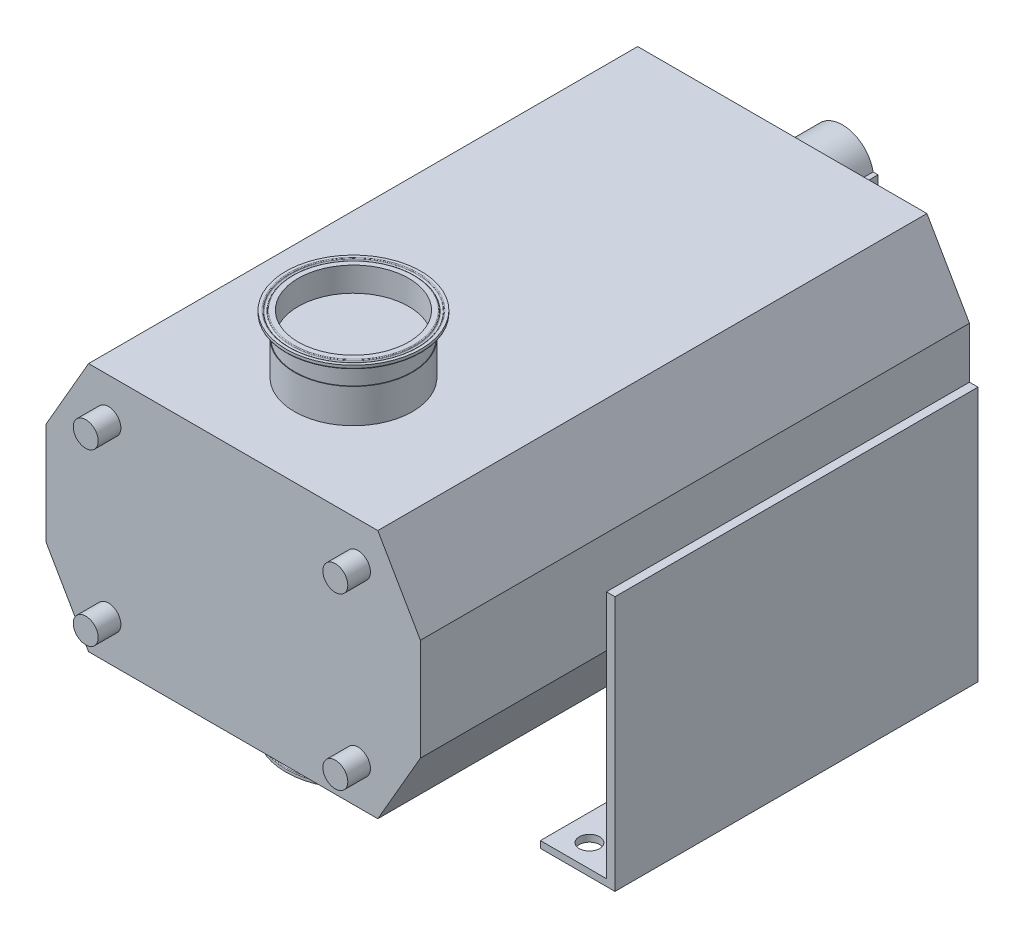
ISO-10303-21;
HEADER;
FILE_DESCRIPTION(('STEP AP214'),'2;1');
FILE_NAME('part.step','',(''),(''),'','','');
FILE_SCHEMA(('AUTOMOTIVE_DESIGN { 1 0 10303 214 1 1 1 1 }'));
ENDSEC;
DATA;
#1=APPLICATION_CONTEXT('core data for automotive mechanical design processes');
#2=APPLICATION_PROTOCOL_DEFINITION('international standard','automotive_design',2000,#1);
#3=PRODUCT_CONTEXT('',#1,'mechanical');
#4=PRODUCT('Part','Part','',(#3));
#5=PRODUCT_RELATED_PRODUCT_CATEGORY('part','',(#4));
#6=PRODUCT_DEFINITION_FORMATION('','',#4);
#7=PRODUCT_DEFINITION_CONTEXT('part definition',#1,'design');
#8=PRODUCT_DEFINITION('design','',#6,#7);
#9=PRODUCT_DEFINITION_SHAPE('','',#8);
#10=(LENGTH_UNIT() NAMED_UNIT(*) SI_UNIT(.MILLI.,.METRE.));
#11=(NAMED_UNIT(*) PLANE_ANGLE_UNIT() SI_UNIT($,.RADIAN.));
#12=(NAMED_UNIT(*) SI_UNIT($,.STERADIAN.) SOLID_ANGLE_UNIT());
#13=UNCERTAINTY_MEASURE_WITH_UNIT(LENGTH_MEASURE(1.E-05),#10,'distance_accuracy_value','');
#14=(GEOMETRIC_REPRESENTATION_CONTEXT(3) GLOBAL_UNCERTAINTY_ASSIGNED_CONTEXT((#13)) GLOBAL_UNIT_ASSIGNED_CONTEXT((#10,
#11,#12)) REPRESENTATION_CONTEXT('',''));
#15=CARTESIAN_POINT('',(0.,0.,0.));
#16=DIRECTION('',(0.,0.,1.));
#17=DIRECTION('',(1.,0.,0.));
#18=AXIS2_PLACEMENT_3D('',#15,#16,#17);
#19=CARTESIAN_POINT('',(-57.0029308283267,161.5,378.));
#20=DIRECTION('',(0.,1.,0.));
#21=DIRECTION('',(0.,0.,1.));
#22=AXIS2_PLACEMENT_3D('',#19,#20,#21);
#23=PLANE('',#22);
#24=CARTESIAN_POINT('',(0.,161.5,378.));
#25=DIRECTION('',(0.,1.,0.));
#26=DIRECTION('',(0.,0.,1.));
#27=AXIS2_PLACEMENT_3D('',#24,#25,#26);
#28=CIRCLE('',#27,59.5);
#29=CARTESIAN_POINT('',(0.,161.5,437.5));
#30=VERTEX_POINT('',#29);
#31=EDGE_CURVE('P0_E10',#30,#30,#28,.T.);
#32=ORIENTED_EDGE('',*,*,#31,.T.);
#33=EDGE_LOOP('',(#32));
#34=FACE_BOUND('',#33,.T.);
#35=CARTESIAN_POINT('',(0.,161.5,378.));
#36=DIRECTION('',(0.,1.,0.));
#37=DIRECTION('',(0.,0.,1.));
#38=AXIS2_PLACEMENT_3D('',#35,#36,#37);
#39=CIRCLE('',#38,57.0029308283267);
#40=CARTESIAN_POINT('',(0.,161.5,435.002930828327));
#41=VERTEX_POINT('',#40);
#42=EDGE_CURVE('P0_E61',#41,#41,#39,.T.);
#43=ORIENTED_EDGE('',*,*,#42,.F.);
#44=EDGE_LOOP('',(#43));
#45=FACE_BOUND('',#44,.T.);
#46=ADVANCED_FACE('P0_F15',(#34,#45),#23,.T.);
#47=CARTESIAN_POINT('',(0.,161.5,378.));
#48=DIRECTION('',(0.,1.,0.));
#49=DIRECTION('',(0.,0.,1.));
#50=AXIS2_PLACEMENT_3D('',#47,#48,#49);
#51=CYLINDRICAL_SURFACE('',#50,59.5);
#52=CARTESIAN_POINT('',(0.,159.210166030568,378.));
#53=DIRECTION('',(0.,1.,0.));
#54=DIRECTION('',(0.,0.,1.));
#55=AXIS2_PLACEMENT_3D('',#52,#53,#54);
#56=CIRCLE('',#55,59.5);
#57=CARTESIAN_POINT('',(0.,159.210166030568,437.5));
#58=VERTEX_POINT('',#57);
#59=EDGE_CURVE('P0_E21',#58,#58,#56,.T.);
#60=ORIENTED_EDGE('',*,*,#59,.T.);
#61=EDGE_LOOP('',(#60));
#62=FACE_BOUND('',#61,.T.);
#63=ORIENTED_EDGE('',*,*,#31,.F.);
#64=EDGE_LOOP('',(#63));
#65=FACE_BOUND('',#64,.T.);
#66=ADVANCED_FACE('P0_F69',(#62,#65),#51,.T.);
#67=CARTESIAN_POINT('',(0.,159.210166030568,378.));
#68=DIRECTION('',(0.,1.,0.));
#69=DIRECTION('',(0.,0.,1.));
#70=AXIS2_PLACEMENT_3D('',#67,#68,#69);
#71=TOROIDAL_SURFACE('',#70,58.7,0.800000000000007);
#72=CARTESIAN_POINT('',(0.,158.458411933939,378.));
#73=DIRECTION('',(0.,1.,0.));
#74=DIRECTION('',(0.,0.,1.));
#75=AXIS2_PLACEMENT_3D('',#72,#73,#74);
#76=CIRCLE('',#75,58.9736161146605);
#77=CARTESIAN_POINT('',(0.,158.458411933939,436.973616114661));
#78=VERTEX_POINT('',#77);
#79=EDGE_CURVE('P0_E25',#78,#78,#76,.T.);
#80=ORIENTED_EDGE('',*,*,#79,.T.);
#81=EDGE_LOOP('',(#80));
#82=FACE_BOUND('',#81,.T.);
#83=ORIENTED_EDGE('',*,*,#59,.F.);
#84=EDGE_LOOP('',(#83));
#85=FACE_BOUND('',#84,.T.);
#86=ADVANCED_FACE('P0_F74',(#82,#85),#71,.T.);
#87=CARTESIAN_POINT('',(0.,158.458411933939,378.));
#88=DIRECTION('',(0.,1.,0.));
#89=DIRECTION('',(0.,0.,1.));
#90=AXIS2_PLACEMENT_3D('',#87,#88,#89);
#91=CONICAL_SURFACE('',#90,58.9736161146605,1.22173047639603);
#92=CARTESIAN_POINT('',(0.,156.217208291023,378.));
#93=DIRECTION('',(0.,1.,0.));
#94=DIRECTION('',(0.,0.,1.));
#95=AXIS2_PLACEMENT_3D('',#92,#93,#94);
#96=CIRCLE('',#95,52.8159597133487);
#97=CARTESIAN_POINT('',(0.,156.217208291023,430.815959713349));
#98=VERTEX_POINT('',#97);
#99=EDGE_CURVE('P0_E29',#98,#98,#96,.T.);
#100=ORIENTED_EDGE('',*,*,#99,.T.);
#101=EDGE_LOOP('',(#100));
#102=FACE_BOUND('',#101,.T.);
#103=ORIENTED_EDGE('',*,*,#79,.F.);
#104=EDGE_LOOP('',(#103));
#105=FACE_BOUND('',#104,.T.);
#106=ADVANCED_FACE('P0_F78',(#102,#105),#91,.T.);
#107=CARTESIAN_POINT('',(0.,154.337823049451,378.));
#108=DIRECTION('',(0.,1.,0.));
#109=DIRECTION('',(0.,0.,1.));
#110=AXIS2_PLACEMENT_3D('',#107,#108,#109);
#111=TOROIDAL_SURFACE('',#110,53.5,2.);
#112=CARTESIAN_POINT('',(0.,154.337823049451,378.));
#113=DIRECTION('',(0.,1.,0.));
#114=DIRECTION('',(0.,0.,1.));
#115=AXIS2_PLACEMENT_3D('',#112,#113,#114);
#116=CIRCLE('',#115,51.5);
#117=CARTESIAN_POINT('',(0.,154.337823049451,429.5));
#118=VERTEX_POINT('',#117);
#119=EDGE_CURVE('P0_E34',#118,#118,#116,.T.);
#120=ORIENTED_EDGE('',*,*,#119,.T.);
#121=EDGE_LOOP('',(#120));
#122=FACE_BOUND('',#121,.T.);
#123=ORIENTED_EDGE('',*,*,#99,.F.);
#124=EDGE_LOOP('',(#123));
#125=FACE_BOUND('',#124,.T.);
#126=ADVANCED_FACE('P0_F85',(#122,#125),#111,.F.);
#127=CARTESIAN_POINT('',(0.,161.5,378.));
#128=DIRECTION('',(0.,1.,0.));
#129=DIRECTION('',(0.,0.,1.));
#130=AXIS2_PLACEMENT_3D('',#127,#128,#129);
#131=CYLINDRICAL_SURFACE('',#130,51.5);
#132=CARTESIAN_POINT('',(0.,140.,378.));
#133=DIRECTION('',(0.,1.,0.));
#134=DIRECTION('',(0.,0.,1.));
#135=AXIS2_PLACEMENT_3D('',#132,#133,#134);
#136=CIRCLE('',#135,51.5);
#137=CARTESIAN_POINT('',(0.,140.,429.5));
#138=VERTEX_POINT('',#137);
#139=EDGE_CURVE('P0_E37',#138,#138,#136,.T.);
#140=ORIENTED_EDGE('',*,*,#139,.T.);
#141=EDGE_LOOP('',(#140));
#142=FACE_BOUND('',#141,.T.);
#143=ORIENTED_EDGE('',*,*,#119,.F.);
#144=EDGE_LOOP('',(#143));
#145=FACE_BOUND('',#144,.T.);
#146=ADVANCED_FACE('P0_F89',(#142,#145),#131,.T.);
#147=CARTESIAN_POINT('',(-48.7,140.,378.));
#148=DIRECTION('',(0.,-1.,0.));
#149=DIRECTION('',(0.,0.,-1.));
#150=AXIS2_PLACEMENT_3D('',#147,#148,#149);
#151=PLANE('',#150);
#152=CARTESIAN_POINT('',(0.,140.,378.));
#153=DIRECTION('',(0.,1.,0.));
#154=DIRECTION('',(0.,0.,1.));
#155=AXIS2_PLACEMENT_3D('',#152,#153,#154);
#156=CIRCLE('',#155,48.7);
#157=CARTESIAN_POINT('',(0.,140.,426.7));
#158=VERTEX_POINT('',#157);
#159=EDGE_CURVE('P0_E40',#158,#158,#156,.T.);
#160=ORIENTED_EDGE('',*,*,#159,.T.);
#161=EDGE_LOOP('',(#160));
#162=FACE_BOUND('',#161,.T.);
#163=ORIENTED_EDGE('',*,*,#139,.F.);
#164=EDGE_LOOP('',(#163));
#165=FACE_BOUND('',#164,.T.);
#166=ADVANCED_FACE('P0_F93',(#162,#165),#151,.T.);
#167=CARTESIAN_POINT('',(0.,161.5,378.));
#168=DIRECTION('',(0.,1.,0.));
#169=DIRECTION('',(0.,0.,1.));
#170=AXIS2_PLACEMENT_3D('',#167,#168,#169);
#171=CYLINDRICAL_SURFACE('',#170,48.7);
#172=CARTESIAN_POINT('',(0.,161.5,378.));
#173=DIRECTION('',(0.,1.,0.));
#174=DIRECTION('',(0.,0.,1.));
#175=AXIS2_PLACEMENT_3D('',#172,#173,#174);
#176=CIRCLE('',#175,48.7);
#177=CARTESIAN_POINT('',(0.,161.5,426.7));
#178=VERTEX_POINT('',#177);
#179=EDGE_CURVE('P0_E43',#178,#178,#176,.T.);
#180=ORIENTED_EDGE('',*,*,#179,.T.);
#181=EDGE_LOOP('',(#180));
#182=FACE_BOUND('',#181,.T.);
#183=ORIENTED_EDGE('',*,*,#159,.F.);
#184=EDGE_LOOP('',(#183));
#185=FACE_BOUND('',#184,.T.);
#186=ADVANCED_FACE('P0_F97',(#182,#185),#171,.F.);
#187=CARTESIAN_POINT('',(-48.6999999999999,161.5,378.));
#188=DIRECTION('',(0.,1.,0.));
#189=DIRECTION('',(0.,0.,1.));
#190=AXIS2_PLACEMENT_3D('',#187,#188,#189);
#191=PLANE('',#190);
#192=CARTESIAN_POINT('',(0.,161.5,378.));
#193=DIRECTION('',(0.,1.,0.));
#194=DIRECTION('',(0.,0.,1.));
#195=AXIS2_PLACEMENT_3D('',#192,#193,#194);
#196=CIRCLE('',#195,52.9970691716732);
#197=CARTESIAN_POINT('',(0.,161.5,430.997069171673));
#198=VERTEX_POINT('',#197);
#199=EDGE_CURVE('P0_E46',#198,#198,#196,.T.);
#200=ORIENTED_EDGE('',*,*,#199,.T.);
#201=EDGE_LOOP('',(#200));
#202=FACE_BOUND('',#201,.T.);
#203=ORIENTED_EDGE('',*,*,#179,.F.);
#204=EDGE_LOOP('',(#203));
#205=FACE_BOUND('',#204,.T.);
#206=ADVANCED_FACE('P0_F101',(#202,#205),#191,.T.);
#207=CARTESIAN_POINT('',(0.,160.7,378.));
#208=DIRECTION('',(0.,1.,0.));
#209=DIRECTION('',(0.,0.,1.));
#210=AXIS2_PLACEMENT_3D('',#207,#208,#209);
#211=TOROIDAL_SURFACE('',#210,52.9970691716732,0.800000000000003);
#212=CARTESIAN_POINT('',(0.,161.012584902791,378.));
#213=DIRECTION('',(0.,1.,0.));
#214=DIRECTION('',(0.,0.,1.));
#215=AXIS2_PLACEMENT_3D('',#212,#213,#214);
#216=CIRCLE('',#215,53.7334730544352);
#217=CARTESIAN_POINT('',(0.,161.012584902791,431.733473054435));
#218=VERTEX_POINT('',#217);
#219=EDGE_CURVE('P0_E49',#218,#218,#216,.T.);
#220=ORIENTED_EDGE('',*,*,#219,.T.);
#221=EDGE_LOOP('',(#220));
#222=FACE_BOUND('',#221,.T.);
#223=ORIENTED_EDGE('',*,*,#199,.F.);
#224=EDGE_LOOP('',(#223));
#225=FACE_BOUND('',#224,.T.);
#226=ADVANCED_FACE('P0_F105',(#222,#225),#211,.T.);
#227=CARTESIAN_POINT('',(0.,161.012584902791,378.));
#228=DIRECTION('',(0.,-1.,0.));
#229=DIRECTION('',(0.,0.,-1.));
#230=AXIS2_PLACEMENT_3D('',#227,#228,#229);
#231=CONICAL_SURFACE('',#230,53.7334730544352,0.401425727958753);
#232=CARTESIAN_POINT('',(0.,160.631122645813,378.));
#233=DIRECTION('',(0.,1.,0.));
#234=DIRECTION('',(0.,0.,1.));
#235=AXIS2_PLACEMENT_3D('',#232,#233,#234);
#236=CIRCLE('',#235,53.8953941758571);
#237=CARTESIAN_POINT('',(0.,160.631122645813,431.895394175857));
#238=VERTEX_POINT('',#237);
#239=EDGE_CURVE('P0_E52',#238,#238,#236,.T.);
#240=ORIENTED_EDGE('',*,*,#239,.T.);
#241=EDGE_LOOP('',(#240));
#242=FACE_BOUND('',#241,.T.);
#243=ORIENTED_EDGE('',*,*,#219,.F.);
#244=EDGE_LOOP('',(#243));
#245=FACE_BOUND('',#244,.T.);
#246=ADVANCED_FACE('P0_F109',(#242,#245),#231,.T.);
#247=CARTESIAN_POINT('',(0.,161.1,378.));
#248=DIRECTION('',(0.,1.,0.));
#249=DIRECTION('',(0.,0.,1.));
#250=AXIS2_PLACEMENT_3D('',#247,#248,#249);
#251=TOROIDAL_SURFACE('',#250,55.,1.2);
#252=CARTESIAN_POINT('',(0.,160.631122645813,378.));
#253=DIRECTION('',(0.,1.,0.));
#254=DIRECTION('',(0.,0.,1.));
#255=AXIS2_PLACEMENT_3D('',#252,#253,#254);
#256=CIRCLE('',#255,56.104605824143);
#257=CARTESIAN_POINT('',(0.,160.631122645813,434.104605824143));
#258=VERTEX_POINT('',#257);
#259=EDGE_CURVE('P0_E55',#258,#258,#256,.T.);
#260=ORIENTED_EDGE('',*,*,#259,.T.);
#261=EDGE_LOOP('',(#260));
#262=FACE_BOUND('',#261,.T.);
#263=ORIENTED_EDGE('',*,*,#239,.F.);
#264=EDGE_LOOP('',(#263));
#265=FACE_BOUND('',#264,.T.);
#266=ADVANCED_FACE('P0_F113',(#262,#265),#251,.F.);
#267=CARTESIAN_POINT('',(0.,160.631122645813,378.));
#268=DIRECTION('',(0.,1.,0.));
#269=DIRECTION('',(0.,0.,1.));
#270=AXIS2_PLACEMENT_3D('',#267,#268,#269);
#271=CONICAL_SURFACE('',#270,56.104605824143,0.40142572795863);
#272=CARTESIAN_POINT('',(0.,161.012584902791,378.));
#273=DIRECTION('',(0.,1.,0.));
#274=DIRECTION('',(0.,0.,1.));
#275=AXIS2_PLACEMENT_3D('',#272,#273,#274);
#276=CIRCLE('',#275,56.2665269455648);
#277=CARTESIAN_POINT('',(0.,161.012584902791,434.266526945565));
#278=VERTEX_POINT('',#277);
#279=EDGE_CURVE('P0_E58',#278,#278,#276,.T.);
#280=ORIENTED_EDGE('',*,*,#279,.T.);
#281=EDGE_LOOP('',(#280));
#282=FACE_BOUND('',#281,.T.);
#283=ORIENTED_EDGE('',*,*,#259,.F.);
#284=EDGE_LOOP('',(#283));
#285=FACE_BOUND('',#284,.T.);
#286=ADVANCED_FACE('P0_F117',(#282,#285),#271,.F.);
#287=CARTESIAN_POINT('',(0.,160.7,378.));
#288=DIRECTION('',(0.,1.,0.));
#289=DIRECTION('',(0.,0.,1.));
#290=AXIS2_PLACEMENT_3D('',#287,#288,#289);
#291=TOROIDAL_SURFACE('',#290,57.0029308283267,0.800000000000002);
#292=ORIENTED_EDGE('',*,*,#42,.T.);
#293=EDGE_LOOP('',(#292));
#294=FACE_BOUND('',#293,.T.);
#295=ORIENTED_EDGE('',*,*,#279,.F.);
#296=EDGE_LOOP('',(#295));
#297=FACE_BOUND('',#296,.T.);
#298=ADVANCED_FACE('P0_F65',(#294,#297),#291,.T.);
#299=CLOSED_SHELL('',(#46,#66,#86,#106,#126,#146,#166,#186,#206,#226,#246,#266,#286,#298));
#300=MANIFOLD_SOLID_BREP('P0_B1',#299);
#301=CARTESIAN_POINT('',(-106.773910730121,-225.,320.));
#302=DIRECTION('',(0.,1.,0.));
#303=DIRECTION('',(0.,0.,1.));
#304=AXIS2_PLACEMENT_3D('',#301,#302,#303);
#305=PLANE('',#304);
#306=CARTESIAN_POINT('',(-130.,-225.,300.));
#307=DIRECTION('',(0.,1.,0.));
#308=DIRECTION('',(0.,0.,-1.));
#309=AXIS2_PLACEMENT_3D('',#306,#307,#308);
#310=CIRCLE('',#309,9.00000000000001);
#311=CARTESIAN_POINT('',(-130.,-225.,291.));
#312=VERTEX_POINT('',#311);
#313=EDGE_CURVE('P1_E575',#312,#312,#310,.T.);
#314=ORIENTED_EDGE('',*,*,#313,.T.);
#315=EDGE_LOOP('',(#314));
#316=FACE_BOUND('',#315,.T.);
#317=DIRECTION('',(1.,0.,0.));
#318=VECTOR('',#317,1.);
#319=CARTESIAN_POINT('',(-106.773910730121,-225.,0.));
#320=LINE('',#319,#318);
#321=CARTESIAN_POINT('',(-172.5,-225.,0.));
#322=VERTEX_POINT('',#321);
#323=CARTESIAN_POINT('',(-106.773910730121,-225.,0.));
#324=VERTEX_POINT('',#323);
#325=EDGE_CURVE('P1_E586',#322,#324,#320,.T.);
#326=ORIENTED_EDGE('',*,*,#325,.T.);
#327=DIRECTION('',(0.,0.,-1.));
#328=VECTOR('',#327,1.);
#329=CARTESIAN_POINT('',(-106.773910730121,-225.,320.));
#330=LINE('',#329,#328);
#331=CARTESIAN_POINT('',(-106.773910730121,-225.,320.));
#332=VERTEX_POINT('',#331);
#333=EDGE_CURVE('P1_E593',#332,#324,#330,.T.);
#334=ORIENTED_EDGE('',*,*,#333,.F.);
#335=DIRECTION('',(1.,0.,0.));
#336=VECTOR('',#335,1.);
#337=CARTESIAN_POINT('',(-106.773910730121,-225.,320.));
#338=LINE('',#337,#336);
#339=CARTESIAN_POINT('',(-172.5,-225.,320.));
#340=VERTEX_POINT('',#339);
#341=EDGE_CURVE('P1_E217',#340,#332,#338,.T.);
#342=ORIENTED_EDGE('',*,*,#341,.F.);
#343=DIRECTION('',(0.,0.,-1.));
#344=VECTOR('',#343,1.);
#345=CARTESIAN_POINT('',(-172.5,-225.,320.));
#346=LINE('',#345,#344);
#347=EDGE_CURVE('P1_E590',#340,#322,#346,.T.);
#348=ORIENTED_EDGE('',*,*,#347,.T.);
#349=EDGE_LOOP('',(#326,#334,#342,#348));
#350=FACE_BOUND('',#349,.T.);
#351=CARTESIAN_POINT('',(-130.,-225.,20.));
#352=DIRECTION('',(0.,1.,0.));
#353=DIRECTION('',(0.,0.,-1.));
#354=AXIS2_PLACEMENT_3D('',#351,#352,#353);
#355=CIRCLE('',#354,9.00000000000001);
#356=CARTESIAN_POINT('',(-130.,-225.,11.));
#357=VERTEX_POINT('',#356);
#358=EDGE_CURVE('P1_E883',#357,#357,#355,.T.);
#359=ORIENTED_EDGE('',*,*,#358,.T.);
#360=EDGE_LOOP('',(#359));
#361=FACE_BOUND('',#360,.T.);
#362=ADVANCED_FACE('P1_F17',(#316,#350,#361),#305,.F.);
#363=CARTESIAN_POINT('',(-165.,-219.,320.));
#364=DIRECTION('',(0.,-1.,0.));
#365=DIRECTION('',(0.,0.,-1.));
#366=AXIS2_PLACEMENT_3D('',#363,#364,#365);
#367=PLANE('',#366);
#368=CARTESIAN_POINT('',(-130.,-219.,300.));
#369=DIRECTION('',(0.,-1.,0.));
#370=DIRECTION('',(0.,0.,-1.));
#371=AXIS2_PLACEMENT_3D('',#368,#369,#370);
#372=CIRCLE('',#371,9.00000000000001);
#373=CARTESIAN_POINT('',(-130.,-219.,291.));
#374=VERTEX_POINT('',#373);
#375=EDGE_CURVE('P1_E579',#374,#374,#372,.T.);
#376=ORIENTED_EDGE('',*,*,#375,.T.);
#377=EDGE_LOOP('',(#376));
#378=FACE_BOUND('',#377,.T.);
#379=DIRECTION('',(-1.,0.,0.));
#380=VECTOR('',#379,1.);
#381=CARTESIAN_POINT('',(-165.,-219.,0.));
#382=LINE('',#381,#380);
#383=CARTESIAN_POINT('',(-106.773910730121,-219.,0.));
#384=VERTEX_POINT('',#383);
#385=CARTESIAN_POINT('',(-165.,-219.,0.));
#386=VERTEX_POINT('',#385);
#387=EDGE_CURVE('P1_E577',#384,#386,#382,.T.);
#388=ORIENTED_EDGE('',*,*,#387,.T.);
#389=DIRECTION('',(0.,0.,-1.));
#390=VECTOR('',#389,1.);
#391=CARTESIAN_POINT('',(-165.,-219.,320.));
#392=LINE('',#391,#390);
#393=CARTESIAN_POINT('',(-165.,-219.,320.));
#394=VERTEX_POINT('',#393);
#395=EDGE_CURVE('P1_E211',#394,#386,#392,.T.);
#396=ORIENTED_EDGE('',*,*,#395,.F.);
#397=DIRECTION('',(-1.,0.,0.));
#398=VECTOR('',#397,1.);
#399=CARTESIAN_POINT('',(-165.,-219.,320.));
#400=LINE('',#399,#398);
#401=CARTESIAN_POINT('',(-106.773910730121,-219.,320.));
#402=VERTEX_POINT('',#401);
#403=EDGE_CURVE('P1_E602',#402,#394,#400,.T.);
#404=ORIENTED_EDGE('',*,*,#403,.F.);
#405=DIRECTION('',(0.,0.,-1.));
#406=VECTOR('',#405,1.);
#407=CARTESIAN_POINT('',(-106.773910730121,-219.,320.));
#408=LINE('',#407,#406);
#409=EDGE_CURVE('P1_E215',#402,#384,#408,.T.);
#410=ORIENTED_EDGE('',*,*,#409,.T.);
#411=EDGE_LOOP('',(#388,#396,#404,#410));
#412=FACE_BOUND('',#411,.T.);
#413=CARTESIAN_POINT('',(-130.,-219.,20.));
#414=DIRECTION('',(0.,-1.,0.));
#415=DIRECTION('',(0.,0.,-1.));
#416=AXIS2_PLACEMENT_3D('',#413,#414,#415);
#417=CIRCLE('',#416,9.00000000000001);
#418=CARTESIAN_POINT('',(-130.,-219.,11.));
#419=VERTEX_POINT('',#418);
#420=EDGE_CURVE('P1_E886',#419,#419,#417,.T.);
#421=ORIENTED_EDGE('',*,*,#420,.T.);
#422=EDGE_LOOP('',(#421));
#423=FACE_BOUND('',#422,.T.);
#424=ADVANCED_FACE('P1_F455',(#378,#412,#423),#367,.F.);
#425=CARTESIAN_POINT('',(-165.,45.,484.));
#426=DIRECTION('',(1.,0.,0.));
#427=DIRECTION('',(0.,0.,-1.));
#428=AXIS2_PLACEMENT_3D('',#425,#426,#427);
#429=PLANE('',#428);
#430=DIRECTION('',(0.,0.,-1.));
#431=VECTOR('',#430,1.);
#432=CARTESIAN_POINT('',(-165.,0.,320.));
#433=LINE('',#432,#431);
#434=CARTESIAN_POINT('',(-165.,0.,320.));
#435=VERTEX_POINT('',#434);
#436=CARTESIAN_POINT('',(-165.,0.,0.));
#437=VERTEX_POINT('',#436);
#438=EDGE_CURVE('P1_E200',#435,#437,#433,.T.);
#439=ORIENTED_EDGE('',*,*,#438,.F.);
#440=DIRECTION('',(0.,1.,0.));
#441=VECTOR('',#440,1.);
#442=CARTESIAN_POINT('',(-165.,0.,320.));
#443=LINE('',#442,#441);
#444=CARTESIAN_POINT('',(-165.,-44.9999999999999,320.));
#445=VERTEX_POINT('',#444);
#446=EDGE_CURVE('P1_E185',#445,#435,#443,.T.);
#447=ORIENTED_EDGE('',*,*,#446,.F.);
#448=DIRECTION('',(0.,0.,-1.));
#449=VECTOR('',#448,1.);
#450=CARTESIAN_POINT('',(-165.,-45.,484.));
#451=LINE('',#450,#449);
#452=CARTESIAN_POINT('',(-165.,-45.,484.));
#453=VERTEX_POINT('',#452);
#454=EDGE_CURVE('P1_E395',#453,#445,#451,.T.);
#455=ORIENTED_EDGE('',*,*,#454,.F.);
#456=DIRECTION('',(0.,-1.,0.));
#457=VECTOR('',#456,1.);
#458=CARTESIAN_POINT('',(-165.,45.,484.));
#459=LINE('',#458,#457);
#460=CARTESIAN_POINT('',(-165.,45.,484.));
#461=VERTEX_POINT('',#460);
#462=EDGE_CURVE('P1_E359',#461,#453,#459,.T.);
#463=ORIENTED_EDGE('',*,*,#462,.F.);
#464=DIRECTION('',(0.,0.,-1.));
#465=VECTOR('',#464,1.);
#466=CARTESIAN_POINT('',(-165.,45.,484.));
#467=LINE('',#466,#465);
#468=CARTESIAN_POINT('',(-165.,45.,0.));
#469=VERTEX_POINT('',#468);
#470=EDGE_CURVE('P1_E397',#461,#469,#467,.T.);
#471=ORIENTED_EDGE('',*,*,#470,.T.);
#472=DIRECTION('',(0.,-1.,0.));
#473=VECTOR('',#472,1.);
#474=CARTESIAN_POINT('',(-165.,45.,0.));
#475=LINE('',#474,#473);
#476=EDGE_CURVE('P1_E210',#469,#437,#475,.T.);
#477=ORIENTED_EDGE('',*,*,#476,.T.);
#478=EDGE_LOOP('',(#439,#447,#455,#463,#471,#477));
#479=FACE_BOUND('',#478,.T.);
#480=ADVANCED_FACE('P1_F207',(#479),#429,.F.);
#481=CARTESIAN_POINT('',(-60.,0.,241.732657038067));
#482=DIRECTION('',(0.,0.,1.));
#483=DIRECTION('',(1.,0.,0.));
#484=AXIS2_PLACEMENT_3D('',#481,#482,#483);
#485=CYLINDRICAL_SURFACE('',#484,27.5);
#486=CARTESIAN_POINT('',(-60.,0.,-3.));
#487=DIRECTION('',(0.,0.,1.));
#488=DIRECTION('',(1.,0.,0.));
#489=AXIS2_PLACEMENT_3D('',#486,#487,#488);
#490=CIRCLE('',#489,27.5);
#491=CARTESIAN_POINT('',(-32.5,0.,-3.));
#492=VERTEX_POINT('',#491);
#493=EDGE_CURVE('P1_E320',#492,#492,#490,.T.);
#494=ORIENTED_EDGE('',*,*,#493,.F.);
#495=EDGE_LOOP('',(#494));
#496=FACE_BOUND('',#495,.T.);
#497=DIRECTION('',(0.,0.,1.));
#498=VECTOR('',#497,1.);
#499=CARTESIAN_POINT('',(-32.9583654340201,4.99999999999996,241.732657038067));
#500=LINE('',#499,#498);
#501=CARTESIAN_POINT('',(-32.9583654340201,5.00000000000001,-113.));
#502=VERTEX_POINT('',#501);
#503=CARTESIAN_POINT('',(-32.9583654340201,5.,-63.));
#504=VERTEX_POINT('',#503);
#505=EDGE_CURVE('P1_E305',#502,#504,#500,.T.);
#506=ORIENTED_EDGE('',*,*,#505,.F.);
#507=CARTESIAN_POINT('',(-60.,0.,-113.));
#508=DIRECTION('',(0.,0.,1.));
#509=DIRECTION('',(1.,0.,0.));
#510=AXIS2_PLACEMENT_3D('',#507,#508,#509);
#511=CIRCLE('',#510,27.5);
#512=CARTESIAN_POINT('',(-32.9583654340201,-4.99999999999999,-113.));
#513=VERTEX_POINT('',#512);
#514=EDGE_CURVE('P1_E318',#502,#513,#511,.T.);
#515=ORIENTED_EDGE('',*,*,#514,.T.);
#516=DIRECTION('',(0.,0.,1.));
#517=VECTOR('',#516,1.);
#518=CARTESIAN_POINT('',(-32.9583654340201,-5.00000000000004,241.732657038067));
#519=LINE('',#518,#517);
#520=CARTESIAN_POINT('',(-32.9583654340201,-5.00000000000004,-62.9999999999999));
#521=VERTEX_POINT('',#520);
#522=EDGE_CURVE('P1_E302',#521,#513,#519,.F.);
#523=ORIENTED_EDGE('',*,*,#522,.F.);
#524=CARTESIAN_POINT('',(-32.5,0.,-68.));
#525=CARTESIAN_POINT('',(-32.4999988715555,0.139243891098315,-68.0000024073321));
#526=CARTESIAN_POINT('',(-32.5010594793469,0.278456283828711,-67.9941816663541));
#527=CARTESIAN_POINT('',(-32.5052698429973,0.555920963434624,-67.9709482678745));
#528=CARTESIAN_POINT('',(-32.5084199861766,0.69417306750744,-67.9535334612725));
#529=CARTESIAN_POINT('',(-32.5167252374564,0.968758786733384,-67.9072300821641));
#530=CARTESIAN_POINT('',(-32.5218815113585,1.10509123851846,-67.8783348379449));
#531=CARTESIAN_POINT('',(-32.5340566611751,1.37484220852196,-67.809282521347));
#532=CARTESIAN_POINT('',(-32.5410762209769,1.50825963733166,-67.7691213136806));
#533=CARTESIAN_POINT('',(-32.5567718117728,1.77102525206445,-67.6779041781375));
#534=CARTESIAN_POINT('',(-32.5654457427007,1.90037835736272,-67.6268620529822));
#535=CARTESIAN_POINT('',(-32.5842196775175,2.15434684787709,-67.5142102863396));
#536=CARTESIAN_POINT('',(-32.5943202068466,2.27896046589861,-67.4525967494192));
#537=CARTESIAN_POINT('',(-32.6156621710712,2.52249441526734,-67.3192919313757));
#538=CARTESIAN_POINT('',(-32.6269030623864,2.64141741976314,-67.2476054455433));
#539=CARTESIAN_POINT('',(-32.6502265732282,2.87287846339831,-67.0946089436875));
#540=CARTESIAN_POINT('',(-32.6623095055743,2.98541410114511,-67.0132953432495));
#541=CARTESIAN_POINT('',(-32.6871037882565,3.20436568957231,-66.8407881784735));
#542=CARTESIAN_POINT('',(-32.6998201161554,3.31071129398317,-66.7495060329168));
#543=CARTESIAN_POINT('',(-32.7254213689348,3.51539543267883,-66.5583162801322));
#544=CARTESIAN_POINT('',(-32.7383063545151,3.61373098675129,-66.458405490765));
#545=CARTESIAN_POINT('',(-32.7638763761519,3.80165254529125,-66.2506992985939));
#546=CARTESIAN_POINT('',(-32.7765614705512,3.89124114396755,-66.1429062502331));
#547=CARTESIAN_POINT('',(-32.8013837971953,4.06111440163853,-65.9200997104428));
#548=CARTESIAN_POINT('',(-32.8135208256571,4.14139561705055,-65.8050835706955));
#549=CARTESIAN_POINT('',(-32.8369804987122,4.29258292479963,-65.5678120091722));
#550=CARTESIAN_POINT('',(-32.8482967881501,4.36341882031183,-65.4455112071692));
#551=CARTESIAN_POINT('',(-32.869695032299,4.4945486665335,-65.1952227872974));
#552=CARTESIAN_POINT('',(-32.8797765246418,4.55483867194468,-65.0672330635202));
#553=CARTESIAN_POINT('',(-32.8983991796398,4.66436791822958,-64.8065544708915));
#554=CARTESIAN_POINT('',(-32.9069410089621,4.71361194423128,-64.6738676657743));
#555=CARTESIAN_POINT('',(-32.922240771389,4.8007169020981,-64.4046947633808));
#556=CARTESIAN_POINT('',(-32.9289980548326,4.83857368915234,-64.2682073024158));
#557=CARTESIAN_POINT('',(-32.9461329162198,4.93382551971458,-63.8576226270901));
#558=CARTESIAN_POINT('',(-32.9536068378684,4.97422708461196,-63.579236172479));
#559=CARTESIAN_POINT('',(-32.9598077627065,5.00782079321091,-63.0196963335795));
#560=CARTESIAN_POINT('',(-32.9585355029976,5.00101691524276,-62.7385431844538));
#561=CARTESIAN_POINT('',(-32.9474824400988,4.94086952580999,-62.1849314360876));
#562=CARTESIAN_POINT('',(-32.9378069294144,4.88810191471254,-61.9124083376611));
#563=CARTESIAN_POINT('',(-32.9111987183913,4.73841411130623,-61.3801594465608));
#564=CARTESIAN_POINT('',(-32.8942657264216,4.64149214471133,-61.120434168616));
#565=CARTESIAN_POINT('',(-32.854940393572,4.40568216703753,-60.619443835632));
#566=CARTESIAN_POINT('',(-32.8325176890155,4.2665596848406,-60.3782916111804));
#567=CARTESIAN_POINT('',(-32.7847594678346,3.95046265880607,-59.9225379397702));
#568=CARTESIAN_POINT('',(-32.7594236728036,3.7734844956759,-59.7079390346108));
#569=CARTESIAN_POINT('',(-32.7082339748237,3.38358496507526,-59.3080525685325));
#570=CARTESIAN_POINT('',(-32.6823779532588,3.17017042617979,-59.1232457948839));
#571=CARTESIAN_POINT('',(-32.6334062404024,2.71511135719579,-58.7919871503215));
#572=CARTESIAN_POINT('',(-32.6102905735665,2.4734665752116,-58.6455356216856));
#573=CARTESIAN_POINT('',(-32.5693615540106,1.96831899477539,-58.3950815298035));
#574=CARTESIAN_POINT('',(-32.5515541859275,1.70479195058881,-58.2911268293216));
#575=CARTESIAN_POINT('',(-32.5232948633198,1.16362103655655,-58.1290920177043));
#576=CARTESIAN_POINT('',(-32.5128421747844,0.885978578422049,-58.0710073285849));
#577=CARTESIAN_POINT('',(-32.5005701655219,0.3285966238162,-58.0030255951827));
#578=CARTESIAN_POINT('',(-32.4986327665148,0.048940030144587,-57.9924694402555));
#579=CARTESIAN_POINT('',(-32.5032842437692,-0.508143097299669,-58.018079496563));
#580=CARTESIAN_POINT('',(-32.5098727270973,-0.78556973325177,-58.0542435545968));
#581=CARTESIAN_POINT('',(-32.5307622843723,-1.32824274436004,-58.1717193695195));
#582=CARTESIAN_POINT('',(-32.5450067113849,-1.59356324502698,-58.2526996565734));
#583=CARTESIAN_POINT('',(-32.5796176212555,-2.10686178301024,-58.4571520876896));
#584=CARTESIAN_POINT('',(-32.5999845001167,-2.35483869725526,-58.5806269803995));
#585=CARTESIAN_POINT('',(-32.644875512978,-2.82923812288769,-58.8680365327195));
#586=CARTESIAN_POINT('',(-32.6694404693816,-3.05541114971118,-59.0323764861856));
#587=CARTESIAN_POINT('',(-32.7198927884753,-3.47720532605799,-59.3963011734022));
#588=CARTESIAN_POINT('',(-32.7457802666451,-3.67282380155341,-59.5958889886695));
#589=CARTESIAN_POINT('',(-32.796349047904,-4.03044352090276,-60.0276163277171));
#590=CARTESIAN_POINT('',(-32.8210113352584,-4.19199619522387,-60.2601299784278));
#591=CARTESIAN_POINT('',(-32.8659621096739,-4.47374938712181,-60.7493937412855));
#592=CARTESIAN_POINT('',(-32.8862507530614,-4.59395138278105,-61.0061429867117));
#593=CARTESIAN_POINT('',(-32.9200118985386,-4.78894965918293,-61.5353646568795));
#594=CARTESIAN_POINT('',(-32.933515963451,-4.86395652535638,-61.80775757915));
#595=CARTESIAN_POINT('',(-32.9522449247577,-4.96707217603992,-62.3617029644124));
#596=CARTESIAN_POINT('',(-32.9574706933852,-4.99518590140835,-62.6432544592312));
#597=CARTESIAN_POINT('',(-32.9586508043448,-5.00153102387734,-63.0637361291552));
#598=CARTESIAN_POINT('',(-32.9579621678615,-4.99782447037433,-63.2026140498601));
#599=CARTESIAN_POINT('',(-32.9544668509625,-4.97888166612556,-63.4795403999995));
#600=CARTESIAN_POINT('',(-32.9516609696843,-4.96364976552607,-63.6175891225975));
#601=CARTESIAN_POINT('',(-32.9440080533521,-4.92176219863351,-63.8919241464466));
#602=CARTESIAN_POINT('',(-32.9391602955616,-4.89510248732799,-64.0282098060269));
#603=CARTESIAN_POINT('',(-32.9275679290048,-4.83057933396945,-64.2979701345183));
#604=CARTESIAN_POINT('',(-32.9208240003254,-4.79271990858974,-64.4314457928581));
#605=CARTESIAN_POINT('',(-32.905642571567,-4.70613665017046,-64.6945299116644));
#606=CARTESIAN_POINT('',(-32.8972073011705,-4.65742711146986,-64.8241432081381));
#607=CARTESIAN_POINT('',(-32.8788810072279,-4.54949424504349,-65.0787530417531));
#608=CARTESIAN_POINT('',(-32.868990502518,-4.49027466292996,-65.2037512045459));
#609=CARTESIAN_POINT('',(-32.8480252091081,-4.36170911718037,-65.4483862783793));
#610=CARTESIAN_POINT('',(-32.836949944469,-4.29235907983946,-65.568021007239));
#611=CARTESIAN_POINT('',(-32.8139305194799,-4.1440622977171,-65.8010379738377));
#612=CARTESIAN_POINT('',(-32.8019866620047,-4.06511889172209,-65.9144223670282));
#613=CARTESIAN_POINT('',(-32.7773783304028,-3.8969465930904,-66.1358269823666));
#614=CARTESIAN_POINT('',(-32.7647059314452,-3.80758543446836,-66.2437458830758));
#615=CARTESIAN_POINT('',(-32.7391619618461,-3.62017233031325,-66.4516566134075));
#616=CARTESIAN_POINT('',(-32.7262904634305,-3.52212347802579,-66.5516512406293));
#617=CARTESIAN_POINT('',(-32.700695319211,-3.31791447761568,-66.743133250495));
#618=CARTESIAN_POINT('',(-32.6879717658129,-3.21174954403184,-66.8346155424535));
#619=CARTESIAN_POINT('',(-32.6630392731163,-2.99212066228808,-67.0083427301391));
#620=CARTESIAN_POINT('',(-32.6508301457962,-2.87865941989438,-67.0905910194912));
#621=CARTESIAN_POINT('',(-32.6271575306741,-2.64414496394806,-67.2459930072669));
#622=CARTESIAN_POINT('',(-32.6157015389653,-2.52303379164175,-67.3190604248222));
#623=CARTESIAN_POINT('',(-32.5939830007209,-2.27502120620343,-67.4546883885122));
#624=CARTESIAN_POINT('',(-32.5837200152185,-2.14812194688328,-67.5172528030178));
#625=CARTESIAN_POINT('',(-32.5646811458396,-1.8894645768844,-67.6314025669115));
#626=CARTESIAN_POINT('',(-32.5559042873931,-1.75770971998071,-67.6829951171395));
#627=CARTESIAN_POINT('',(-32.5400817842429,-1.4902518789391,-67.7748453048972));
#628=CARTESIAN_POINT('',(-32.5330357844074,-1.35454971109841,-67.815105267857));
#629=CARTESIAN_POINT('',(-32.5181567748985,-1.01869381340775,-67.8994044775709));
#630=CARTESIAN_POINT('',(-32.5113812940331,-0.816859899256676,-67.9370801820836));
#631=CARTESIAN_POINT('',(-32.5023037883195,-0.409994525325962,-67.9873758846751));
#632=CARTESIAN_POINT('',(-32.500001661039,-0.2049631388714,-67.999996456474));
#633=CARTESIAN_POINT('',(-32.5,0.,-68.));
#634=B_SPLINE_CURVE_WITH_KNOTS('',3,(#524,#525,#526,#527,#528,#529,#530,#531,#532,#533,#534,
#535,#536,#537,#538,#539,#540,#541,#542,#543,#544,#545,#546,#547,#548,#549,#550,#551,#552,#553,
#554,#555,#556,#557,#558,#559,#560,#561,#562,#563,#564,#565,#566,#567,#568,#569,#570,#571,#572,
#573,#574,#575,#576,#577,#578,#579,#580,#581,#582,#583,#584,#585,#586,#587,#588,#589,#590,#591,
#592,#593,#594,#595,#596,#597,#598,#599,#600,#601,#602,#603,#604,#605,#606,#607,#608,#609,#610,
#611,#612,#613,#614,#615,#616,#617,#618,#619,#620,#621,#622,#623,#624,#625,#626,#627,#628,#629,
#630,#631,#632,#633),.UNSPECIFIED.,.T.,.F.,(4,2,2,2,2,2,2,2,2,2,2,2,2,2,2,2,2,2,2,2,2,2,2,2,2,2,
2,2,2,2,2,2,2,2,2,2,2,2,2,2,2,2,2,2,2,2,2,2,2,2,2,2,2,2,4),(0.,0.417551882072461,
0.835181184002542,1.25305354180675,1.67107948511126,2.0885782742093,2.50623123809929,
2.9236860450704,3.34129677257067,3.76297827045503,4.18481594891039,4.60652813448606,
5.02839585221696,5.45324223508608,5.87824721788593,6.3030677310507,6.72804268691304,
7.56780375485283,8.40749405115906,9.23681240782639,10.0661640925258,10.9002108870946,
11.7343374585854,12.5808084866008,13.4272870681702,14.2747164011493,15.1220611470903,
15.9576182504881,16.7931368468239,17.6225568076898,18.4520304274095,19.2900838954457,
20.1282106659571,20.9767658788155,21.8252907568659,22.6698307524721,23.5142817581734,
23.9306627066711,24.3468865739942,24.7632578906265,25.1794800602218,25.595157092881,
26.0106862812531,26.4263830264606,26.8419355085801,27.2634991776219,27.6849133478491,
28.1065779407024,28.5280870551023,28.9533006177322,29.3783572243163,29.8031339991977,
30.2278235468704,30.8424623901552,31.4570871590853),.UNSPECIFIED.);
#635=EDGE_CURVE('P1_E25',#504,#521,#634,.T.);
#636=ORIENTED_EDGE('',*,*,#635,.F.);
#637=EDGE_LOOP('',(#506,#515,#523,#636));
#638=FACE_BOUND('',#637,.T.);
#639=ADVANCED_FACE('P1_F414',(#496,#638),#485,.T.);
#640=CARTESIAN_POINT('',(190.980762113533,0.,0.));
#641=DIRECTION('',(0.,0.,1.));
#642=DIRECTION('',(1.,0.,0.));
#643=AXIS2_PLACEMENT_3D('',#640,#641,#642);
#644=PLANE('',#643);
#645=DIRECTION('',(-0.500000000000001,0.866025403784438,0.));
#646=VECTOR('',#645,1.);
#647=CARTESIAN_POINT('',(127.472232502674,110.,0.));
#648=LINE('',#647,#646);
#649=CARTESIAN_POINT('',(165.,45.,0.));
#650=VERTEX_POINT('',#649);
#651=CARTESIAN_POINT('',(127.472232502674,110.,0.));
#652=VERTEX_POINT('',#651);
#653=EDGE_CURVE('P1_E348',#650,#652,#648,.T.);
#654=ORIENTED_EDGE('',*,*,#653,.F.);
#655=DIRECTION('',(0.,1.,0.));
#656=VECTOR('',#655,1.);
#657=CARTESIAN_POINT('',(165.,45.,0.));
#658=LINE('',#657,#656);
#659=CARTESIAN_POINT('',(165.,0.,0.));
#660=VERTEX_POINT('',#659);
#661=EDGE_CURVE('P1_E355',#660,#650,#658,.T.);
#662=ORIENTED_EDGE('',*,*,#661,.F.);
#663=DIRECTION('',(1.,0.,0.));
#664=VECTOR('',#663,1.);
#665=CARTESIAN_POINT('',(172.5,0.,0.));
#666=LINE('',#665,#664);
#667=CARTESIAN_POINT('',(172.5,0.,0.));
#668=VERTEX_POINT('',#667);
#669=EDGE_CURVE('P1_E231',#660,#668,#666,.T.);
#670=ORIENTED_EDGE('',*,*,#669,.T.);
#671=DIRECTION('',(0.,-1.,0.));
#672=VECTOR('',#671,1.);
#673=CARTESIAN_POINT('',(172.5,-225.,0.));
#674=LINE('',#673,#672);
#675=CARTESIAN_POINT('',(172.5,-225.,0.));
#676=VERTEX_POINT('',#675);
#677=EDGE_CURVE('P1_E256',#668,#676,#674,.T.);
#678=ORIENTED_EDGE('',*,*,#677,.T.);
#679=DIRECTION('',(-1.,0.,0.));
#680=VECTOR('',#679,1.);
#681=CARTESIAN_POINT('',(106.773910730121,-225.,0.));
#682=LINE('',#681,#680);
#683=CARTESIAN_POINT('',(106.773910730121,-225.,0.));
#684=VERTEX_POINT('',#683);
#685=EDGE_CURVE('P1_E259',#676,#684,#682,.T.);
#686=ORIENTED_EDGE('',*,*,#685,.T.);
#687=DIRECTION('',(0.,1.,0.));
#688=VECTOR('',#687,1.);
#689=CARTESIAN_POINT('',(106.773910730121,-219.,0.));
#690=LINE('',#689,#688);
#691=CARTESIAN_POINT('',(106.773910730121,-219.,0.));
#692=VERTEX_POINT('',#691);
#693=EDGE_CURVE('P1_E262',#684,#692,#690,.T.);
#694=ORIENTED_EDGE('',*,*,#693,.T.);
#695=DIRECTION('',(1.,0.,0.));
#696=VECTOR('',#695,1.);
#697=CARTESIAN_POINT('',(165.,-219.,0.));
#698=LINE('',#697,#696);
#699=CARTESIAN_POINT('',(165.,-219.,0.));
#700=VERTEX_POINT('',#699);
#701=EDGE_CURVE('P1_E265',#692,#700,#698,.T.);
#702=ORIENTED_EDGE('',*,*,#701,.T.);
#703=DIRECTION('',(0.,1.,0.));
#704=VECTOR('',#703,1.);
#705=CARTESIAN_POINT('',(165.,0.,0.));
#706=LINE('',#705,#704);
#707=CARTESIAN_POINT('',(165.,-45.,0.));
#708=VERTEX_POINT('',#707);
#709=EDGE_CURVE('P1_E238',#700,#708,#706,.T.);
#710=ORIENTED_EDGE('',*,*,#709,.T.);
#711=DIRECTION('',(0.500000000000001,0.866025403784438,0.));
#712=VECTOR('',#711,1.);
#713=CARTESIAN_POINT('',(127.472232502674,-110.,0.));
#714=LINE('',#713,#712);
#715=CARTESIAN_POINT('',(127.472232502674,-110.,0.));
#716=VERTEX_POINT('',#715);
#717=EDGE_CURVE('P1_E381',#716,#708,#714,.T.);
#718=ORIENTED_EDGE('',*,*,#717,.F.);
#719=DIRECTION('',(1.,0.,0.));
#720=VECTOR('',#719,1.);
#721=CARTESIAN_POINT('',(-127.472232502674,-110.,0.));
#722=LINE('',#721,#720);
#723=CARTESIAN_POINT('',(-127.472232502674,-110.,0.));
#724=VERTEX_POINT('',#723);
#725=EDGE_CURVE('P1_E379',#724,#716,#722,.T.);
#726=ORIENTED_EDGE('',*,*,#725,.F.);
#727=DIRECTION('',(0.500000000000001,-0.866025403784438,0.));
#728=VECTOR('',#727,1.);
#729=CARTESIAN_POINT('',(-127.472232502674,-110.,0.));
#730=LINE('',#729,#728);
#731=CARTESIAN_POINT('',(-165.,-45.,0.));
#732=VERTEX_POINT('',#731);
#733=EDGE_CURVE('P1_E377',#732,#724,#730,.T.);
#734=ORIENTED_EDGE('',*,*,#733,.F.);
#735=DIRECTION('',(0.,1.,0.));
#736=VECTOR('',#735,1.);
#737=CARTESIAN_POINT('',(-165.,0.,0.));
#738=LINE('',#737,#736);
#739=EDGE_CURVE('P1_E574',#386,#732,#738,.T.);
#740=ORIENTED_EDGE('',*,*,#739,.F.);
#741=ORIENTED_EDGE('',*,*,#387,.F.);
#742=DIRECTION('',(0.,1.,0.));
#743=VECTOR('',#742,1.);
#744=CARTESIAN_POINT('',(-106.773910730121,-219.,0.));
#745=LINE('',#744,#743);
#746=EDGE_CURVE('P1_E584',#324,#384,#745,.T.);
#747=ORIENTED_EDGE('',*,*,#746,.F.);
#748=ORIENTED_EDGE('',*,*,#325,.F.);
#749=DIRECTION('',(0.,-1.,0.));
#750=VECTOR('',#749,1.);
#751=CARTESIAN_POINT('',(-172.5,-225.,0.));
#752=LINE('',#751,#750);
#753=CARTESIAN_POINT('',(-172.5,0.,0.));
#754=VERTEX_POINT('',#753);
#755=EDGE_CURVE('P1_E204',#754,#322,#752,.T.);
#756=ORIENTED_EDGE('',*,*,#755,.F.);
#757=DIRECTION('',(-1.,0.,0.));
#758=VECTOR('',#757,1.);
#759=CARTESIAN_POINT('',(-172.5,0.,0.));
#760=LINE('',#759,#758);
#761=EDGE_CURVE('P1_E572',#437,#754,#760,.T.);
#762=ORIENTED_EDGE('',*,*,#761,.F.);
#763=ORIENTED_EDGE('',*,*,#476,.F.);
#764=DIRECTION('',(-0.500000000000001,-0.866025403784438,0.));
#765=VECTOR('',#764,1.);
#766=CARTESIAN_POINT('',(-127.472232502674,110.,0.));
#767=LINE('',#766,#765);
#768=CARTESIAN_POINT('',(-127.472232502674,110.,0.));
#769=VERTEX_POINT('',#768);
#770=EDGE_CURVE('P1_E374',#769,#469,#767,.T.);
#771=ORIENTED_EDGE('',*,*,#770,.F.);
#772=DIRECTION('',(-1.,0.,0.));
#773=VECTOR('',#772,1.);
#774=CARTESIAN_POINT('',(-127.472232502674,110.,0.));
#775=LINE('',#774,#773);
#776=EDGE_CURVE('P1_E372',#652,#769,#775,.T.);
#777=ORIENTED_EDGE('',*,*,#776,.F.);
#778=EDGE_LOOP('',(#654,#662,#670,#678,#686,#694,#702,#710,#718,#726,#734,#740,#741,#747,#748,
#756,#762,#763,#771,#777));
#779=FACE_BOUND('',#778,.T.);
#780=CARTESIAN_POINT('',(-60.,0.,0.));
#781=DIRECTION('',(0.,0.,1.));
#782=DIRECTION('',(1.,0.,0.));
#783=AXIS2_PLACEMENT_3D('',#780,#781,#782);
#784=CIRCLE('',#783,30.5);
#785=CARTESIAN_POINT('',(-29.5,0.,0.));
#786=VERTEX_POINT('',#785);
#787=EDGE_CURVE('P1_E405',#786,#786,#784,.F.);
#788=ORIENTED_EDGE('',*,*,#787,.F.);
#789=EDGE_LOOP('',(#788));
#790=FACE_BOUND('',#789,.T.);
#791=ADVANCED_FACE('P1_F532',(#779,#790),#644,.F.);
#792=CARTESIAN_POINT('',(190.980762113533,0.,484.));
#793=DIRECTION('',(0.,0.,1.));
#794=DIRECTION('',(1.,0.,0.));
#795=AXIS2_PLACEMENT_3D('',#792,#793,#794);
#796=PLANE('',#795);
#797=CARTESIAN_POINT('',(110.,-74.9999999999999,484.));
#798=DIRECTION('',(0.,0.,1.));
#799=DIRECTION('',(1.,0.,0.));
#800=AXIS2_PLACEMENT_3D('',#797,#798,#799);
#801=CIRCLE('',#800,11.);
#802=CARTESIAN_POINT('',(121.,-74.9999999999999,484.));
#803=VERTEX_POINT('',#802);
#804=EDGE_CURVE('P1_E330',#803,#803,#801,.T.);
#805=ORIENTED_EDGE('',*,*,#804,.F.);
#806=EDGE_LOOP('',(#805));
#807=FACE_BOUND('',#806,.T.);
#808=CARTESIAN_POINT('',(-110.,75.,484.));
#809=DIRECTION('',(0.,0.,1.));
#810=DIRECTION('',(1.,0.,0.));
#811=AXIS2_PLACEMENT_3D('',#808,#809,#810);
#812=CIRCLE('',#811,11.);
#813=CARTESIAN_POINT('',(-99.,75.,484.));
#814=VERTEX_POINT('',#813);
#815=EDGE_CURVE('P1_E342',#814,#814,#812,.T.);
#816=ORIENTED_EDGE('',*,*,#815,.F.);
#817=EDGE_LOOP('',(#816));
#818=FACE_BOUND('',#817,.T.);
#819=DIRECTION('',(-0.500000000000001,0.866025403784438,0.));
#820=VECTOR('',#819,1.);
#821=CARTESIAN_POINT('',(127.472232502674,110.,484.));
#822=LINE('',#821,#820);
#823=CARTESIAN_POINT('',(165.,45.,484.));
#824=VERTEX_POINT('',#823);
#825=CARTESIAN_POINT('',(127.472232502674,110.,484.));
#826=VERTEX_POINT('',#825);
#827=EDGE_CURVE('P1_E351',#824,#826,#822,.T.);
#828=ORIENTED_EDGE('',*,*,#827,.T.);
#829=DIRECTION('',(-1.,0.,0.));
#830=VECTOR('',#829,1.);
#831=CARTESIAN_POINT('',(-127.472232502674,110.,484.));
#832=LINE('',#831,#830);
#833=CARTESIAN_POINT('',(-127.472232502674,110.,484.));
#834=VERTEX_POINT('',#833);
#835=EDGE_CURVE('P1_E354',#826,#834,#832,.T.);
#836=ORIENTED_EDGE('',*,*,#835,.T.);
#837=DIRECTION('',(-0.500000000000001,-0.866025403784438,0.));
#838=VECTOR('',#837,1.);
#839=CARTESIAN_POINT('',(-127.472232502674,110.,484.));
#840=LINE('',#839,#838);
#841=EDGE_CURVE('P1_E357',#834,#461,#840,.T.);
#842=ORIENTED_EDGE('',*,*,#841,.T.);
#843=ORIENTED_EDGE('',*,*,#462,.T.);
#844=DIRECTION('',(0.500000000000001,-0.866025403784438,0.));
#845=VECTOR('',#844,1.);
#846=CARTESIAN_POINT('',(-127.472232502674,-110.,484.));
#847=LINE('',#846,#845);
#848=CARTESIAN_POINT('',(-127.472232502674,-110.,484.));
#849=VERTEX_POINT('',#848);
#850=EDGE_CURVE('P1_E361',#453,#849,#847,.T.);
#851=ORIENTED_EDGE('',*,*,#850,.T.);
#852=DIRECTION('',(1.,0.,0.));
#853=VECTOR('',#852,1.);
#854=CARTESIAN_POINT('',(-127.472232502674,-110.,484.));
#855=LINE('',#854,#853);
#856=CARTESIAN_POINT('',(127.472232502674,-110.,484.));
#857=VERTEX_POINT('',#856);
#858=EDGE_CURVE('P1_E363',#849,#857,#855,.T.);
#859=ORIENTED_EDGE('',*,*,#858,.T.);
#860=DIRECTION('',(0.500000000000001,0.866025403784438,0.));
#861=VECTOR('',#860,1.);
#862=CARTESIAN_POINT('',(127.472232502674,-110.,484.));
#863=LINE('',#862,#861);
#864=CARTESIAN_POINT('',(165.,-45.,484.));
#865=VERTEX_POINT('',#864);
#866=EDGE_CURVE('P1_E365',#857,#865,#863,.T.);
#867=ORIENTED_EDGE('',*,*,#866,.T.);
#868=DIRECTION('',(0.,1.,0.));
#869=VECTOR('',#868,1.);
#870=CARTESIAN_POINT('',(165.,45.,484.));
#871=LINE('',#870,#869);
#872=EDGE_CURVE('P1_E367',#865,#824,#871,.T.);
#873=ORIENTED_EDGE('',*,*,#872,.T.);
#874=EDGE_LOOP('',(#828,#836,#842,#843,#851,#859,#867,#873));
#875=FACE_BOUND('',#874,.T.);
#876=CARTESIAN_POINT('',(110.,74.9999999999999,484.));
#877=DIRECTION('',(0.,0.,1.));
#878=DIRECTION('',(1.,0.,0.));
#879=AXIS2_PLACEMENT_3D('',#876,#877,#878);
#880=CIRCLE('',#879,11.);
#881=CARTESIAN_POINT('',(121.,74.9999999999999,484.));
#882=VERTEX_POINT('',#881);
#883=EDGE_CURVE('P1_E336',#882,#882,#880,.T.);
#884=ORIENTED_EDGE('',*,*,#883,.F.);
#885=EDGE_LOOP('',(#884));
#886=FACE_BOUND('',#885,.T.);
#887=CARTESIAN_POINT('',(-110.,-75.,484.));
#888=DIRECTION('',(0.,0.,1.));
#889=DIRECTION('',(1.,0.,0.));
#890=AXIS2_PLACEMENT_3D('',#887,#888,#889);
#891=CIRCLE('',#890,11.);
#892=CARTESIAN_POINT('',(-99.,-75.,484.));
#893=VERTEX_POINT('',#892);
#894=EDGE_CURVE('P1_E326',#893,#893,#891,.T.);
#895=ORIENTED_EDGE('',*,*,#894,.F.);
#896=EDGE_LOOP('',(#895));
#897=FACE_BOUND('',#896,.T.);
#898=ADVANCED_FACE('P1_F539',(#807,#818,#875,#886,#897),#796,.T.);
#899=CARTESIAN_POINT('',(127.472232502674,110.,484.));
#900=DIRECTION('',(-0.866025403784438,-0.500000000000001,0.));
#901=DIRECTION('',(0.500000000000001,-0.866025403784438,0.));
#902=AXIS2_PLACEMENT_3D('',#899,#900,#901);
#903=PLANE('',#902);
#904=ORIENTED_EDGE('',*,*,#653,.T.);
#905=DIRECTION('',(0.,0.,-1.));
#906=VECTOR('',#905,1.);
#907=CARTESIAN_POINT('',(127.472232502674,110.,484.));
#908=LINE('',#907,#906);
#909=EDGE_CURVE('P1_E402',#826,#652,#908,.T.);
#910=ORIENTED_EDGE('',*,*,#909,.F.);
#911=ORIENTED_EDGE('',*,*,#827,.F.);
#912=DIRECTION('',(0.,0.,-1.));
#913=VECTOR('',#912,1.);
#914=CARTESIAN_POINT('',(165.,45.,484.));
#915=LINE('',#914,#913);
#916=EDGE_CURVE('P1_E369',#824,#650,#915,.T.);
#917=ORIENTED_EDGE('',*,*,#916,.T.);
#918=EDGE_LOOP('',(#904,#910,#911,#917));
#919=FACE_BOUND('',#918,.T.);
#920=ADVANCED_FACE('P1_F19',(#919),#903,.F.);
#921=CARTESIAN_POINT('',(-127.472232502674,110.,484.));
#922=DIRECTION('',(0.,-1.,0.));
#923=DIRECTION('',(1.,0.,0.));
#924=AXIS2_PLACEMENT_3D('',#921,#922,#923);
#925=PLANE('',#924);
#926=CARTESIAN_POINT('',(0.,110.,378.));
#927=DIRECTION('',(0.,-1.,0.));
#928=DIRECTION('',(1.,0.,0.));
#929=AXIS2_PLACEMENT_3D('',#926,#927,#928);
#930=CIRCLE('',#929,52.);
#931=CARTESIAN_POINT('',(52.,110.,378.));
#932=VERTEX_POINT('',#931);
#933=EDGE_CURVE('P1_E315',#932,#932,#930,.T.);
#934=ORIENTED_EDGE('',*,*,#933,.T.);
#935=EDGE_LOOP('',(#934));
#936=FACE_BOUND('',#935,.T.);
#937=ORIENTED_EDGE('',*,*,#776,.T.);
#938=DIRECTION('',(0.,0.,-1.));
#939=VECTOR('',#938,1.);
#940=CARTESIAN_POINT('',(-127.472232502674,110.,484.));
#941=LINE('',#940,#939);
#942=EDGE_CURVE('P1_E399',#834,#769,#941,.T.);
#943=ORIENTED_EDGE('',*,*,#942,.F.);
#944=ORIENTED_EDGE('',*,*,#835,.F.);
#945=ORIENTED_EDGE('',*,*,#909,.T.);
#946=EDGE_LOOP('',(#937,#943,#944,#945));
#947=FACE_BOUND('',#946,.T.);
#948=ADVANCED_FACE('P1_F554',(#936,#947),#925,.F.);
#949=CARTESIAN_POINT('',(-127.472232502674,110.,484.));
#950=DIRECTION('',(0.866025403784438,-0.500000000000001,0.));
#951=DIRECTION('',(0.500000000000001,0.866025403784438,0.));
#952=AXIS2_PLACEMENT_3D('',#949,#950,#951);
#953=PLANE('',#952);
#954=ORIENTED_EDGE('',*,*,#770,.T.);
#955=ORIENTED_EDGE('',*,*,#470,.F.);
#956=ORIENTED_EDGE('',*,*,#841,.F.);
#957=ORIENTED_EDGE('',*,*,#942,.T.);
#958=EDGE_LOOP('',(#954,#955,#956,#957));
#959=FACE_BOUND('',#958,.T.);
#960=ADVANCED_FACE('P1_F552',(#959),#953,.F.);
#961=CARTESIAN_POINT('',(-127.472232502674,-110.,484.));
#962=DIRECTION('',(0.866025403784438,0.500000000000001,0.));
#963=DIRECTION('',(-0.500000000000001,0.866025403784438,0.));
#964=AXIS2_PLACEMENT_3D('',#961,#962,#963);
#965=PLANE('',#964);
#966=ORIENTED_EDGE('',*,*,#733,.T.);
#967=DIRECTION('',(0.,0.,-1.));
#968=VECTOR('',#967,1.);
#969=CARTESIAN_POINT('',(-127.472232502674,-110.,484.));
#970=LINE('',#969,#968);
#971=EDGE_CURVE('P1_E391',#849,#724,#970,.T.);
#972=ORIENTED_EDGE('',*,*,#971,.F.);
#973=ORIENTED_EDGE('',*,*,#850,.F.);
#974=ORIENTED_EDGE('',*,*,#454,.T.);
#975=EDGE_CURVE('P1_E394',#445,#732,#451,.T.);
#976=ORIENTED_EDGE('',*,*,#975,.T.);
#977=EDGE_LOOP('',(#966,#972,#973,#974,#976));
#978=FACE_BOUND('',#977,.T.);
#979=ADVANCED_FACE('P1_F550',(#978),#965,.F.);
#980=CARTESIAN_POINT('',(-127.472232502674,-110.,484.));
#981=DIRECTION('',(0.,1.,0.));
#982=DIRECTION('',(-1.,0.,0.));
#983=AXIS2_PLACEMENT_3D('',#980,#981,#982);
#984=PLANE('',#983);
#985=CARTESIAN_POINT('',(0.,-110.,378.));
#986=DIRECTION('',(0.,1.,0.));
#987=DIRECTION('',(-1.,0.,0.));
#988=AXIS2_PLACEMENT_3D('',#985,#986,#987);
#989=CIRCLE('',#988,52.);
#990=CARTESIAN_POINT('',(-52.,-110.,378.));
#991=VERTEX_POINT('',#990);
#992=EDGE_CURVE('P1_E314',#991,#991,#989,.T.);
#993=ORIENTED_EDGE('',*,*,#992,.T.);
#994=EDGE_LOOP('',(#993));
#995=FACE_BOUND('',#994,.T.);
#996=ORIENTED_EDGE('',*,*,#725,.T.);
#997=DIRECTION('',(0.,0.,-1.));
#998=VECTOR('',#997,1.);
#999=CARTESIAN_POINT('',(127.472232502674,-110.,484.));
#1000=LINE('',#999,#998);
#1001=EDGE_CURVE('P1_E388',#857,#716,#1000,.T.);
#1002=ORIENTED_EDGE('',*,*,#1001,.F.);
#1003=ORIENTED_EDGE('',*,*,#858,.F.);
#1004=ORIENTED_EDGE('',*,*,#971,.T.);
#1005=EDGE_LOOP('',(#996,#1002,#1003,#1004));
#1006=FACE_BOUND('',#1005,.T.);
#1007=ADVANCED_FACE('P1_F639',(#995,#1006),#984,.F.);
#1008=CARTESIAN_POINT('',(127.472232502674,-110.,484.));
#1009=DIRECTION('',(-0.866025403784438,0.500000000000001,0.));
#1010=DIRECTION('',(-0.500000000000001,-0.866025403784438,0.));
#1011=AXIS2_PLACEMENT_3D('',#1008,#1009,#1010);
#1012=PLANE('',#1011);
#1013=ORIENTED_EDGE('',*,*,#717,.T.);
#1014=DIRECTION('',(0.,0.,-1.));
#1015=VECTOR('',#1014,1.);
#1016=CARTESIAN_POINT('',(165.,-45.,484.));
#1017=LINE('',#1016,#1015);
#1018=CARTESIAN_POINT('',(165.,-45.,320.));
#1019=VERTEX_POINT('',#1018);
#1020=EDGE_CURVE('P1_E38',#1019,#708,#1017,.T.);
#1021=ORIENTED_EDGE('',*,*,#1020,.F.);
#1022=EDGE_CURVE('P1_E386',#865,#1019,#1017,.T.);
#1023=ORIENTED_EDGE('',*,*,#1022,.F.);
#1024=ORIENTED_EDGE('',*,*,#866,.F.);
#1025=ORIENTED_EDGE('',*,*,#1001,.T.);
#1026=EDGE_LOOP('',(#1013,#1021,#1023,#1024,#1025));
#1027=FACE_BOUND('',#1026,.T.);
#1028=ADVANCED_FACE('P1_F634',(#1027),#1012,.F.);
#1029=CARTESIAN_POINT('',(165.,45.,484.));
#1030=DIRECTION('',(-1.,0.,0.));
#1031=DIRECTION('',(0.,0.,1.));
#1032=AXIS2_PLACEMENT_3D('',#1029,#1030,#1031);
#1033=PLANE('',#1032);
#1034=DIRECTION('',(0.,1.,0.));
#1035=VECTOR('',#1034,1.);
#1036=CARTESIAN_POINT('',(165.,45.,320.));
#1037=LINE('',#1036,#1035);
#1038=CARTESIAN_POINT('',(165.,0.,320.));
#1039=VERTEX_POINT('',#1038);
#1040=EDGE_CURVE('P1_E11',#1019,#1039,#1037,.T.);
#1041=ORIENTED_EDGE('',*,*,#1040,.T.);
#1042=DIRECTION('',(0.,0.,-1.));
#1043=VECTOR('',#1042,1.);
#1044=CARTESIAN_POINT('',(165.,0.,320.));
#1045=LINE('',#1044,#1043);
#1046=EDGE_CURVE('P1_E270',#1039,#660,#1045,.T.);
#1047=ORIENTED_EDGE('',*,*,#1046,.T.);
#1048=ORIENTED_EDGE('',*,*,#661,.T.);
#1049=ORIENTED_EDGE('',*,*,#916,.F.);
#1050=ORIENTED_EDGE('',*,*,#872,.F.);
#1051=ORIENTED_EDGE('',*,*,#1022,.T.);
#1052=EDGE_LOOP('',(#1041,#1047,#1048,#1049,#1050,#1051));
#1053=FACE_BOUND('',#1052,.T.);
#1054=ADVANCED_FACE('P1_F619',(#1053),#1033,.F.);
#1055=CARTESIAN_POINT('',(-110.,75.,504.));
#1056=DIRECTION('',(0.,0.,-1.));
#1057=DIRECTION('',(-1.,0.,0.));
#1058=AXIS2_PLACEMENT_3D('',#1055,#1056,#1057);
#1059=CYLINDRICAL_SURFACE('',#1058,11.);
#1060=CARTESIAN_POINT('',(-110.,75.,504.));
#1061=DIRECTION('',(0.,0.,1.));
#1062=DIRECTION('',(1.,0.,0.));
#1063=AXIS2_PLACEMENT_3D('',#1060,#1061,#1062);
#1064=CIRCLE('',#1063,11.);
#1065=CARTESIAN_POINT('',(-99.,75.,504.));
#1066=VERTEX_POINT('',#1065);
#1067=EDGE_CURVE('P1_E345',#1066,#1066,#1064,.T.);
#1068=ORIENTED_EDGE('',*,*,#1067,.F.);
#1069=EDGE_LOOP('',(#1068));
#1070=FACE_BOUND('',#1069,.T.);
#1071=ORIENTED_EDGE('',*,*,#815,.T.);
#1072=EDGE_LOOP('',(#1071));
#1073=FACE_BOUND('',#1072,.T.);
#1074=ADVANCED_FACE('P1_F650',(#1070,#1073),#1059,.T.);
#1075=CARTESIAN_POINT('',(-110.,75.,504.));
#1076=DIRECTION('',(0.,0.,1.));
#1077=DIRECTION('',(1.,0.,0.));
#1078=AXIS2_PLACEMENT_3D('',#1075,#1076,#1077);
#1079=PLANE('',#1078);
#1080=ORIENTED_EDGE('',*,*,#1067,.T.);
#1081=EDGE_LOOP('',(#1080));
#1082=FACE_BOUND('',#1081,.T.);
#1083=ADVANCED_FACE('P1_F657',(#1082),#1079,.T.);
#1084=CARTESIAN_POINT('',(110.,74.9999999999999,504.));
#1085=DIRECTION('',(0.,0.,-1.));
#1086=DIRECTION('',(-1.,0.,0.));
#1087=AXIS2_PLACEMENT_3D('',#1084,#1085,#1086);
#1088=CYLINDRICAL_SURFACE('',#1087,11.);
#1089=CARTESIAN_POINT('',(110.,74.9999999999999,504.));
#1090=DIRECTION('',(0.,0.,1.));
#1091=DIRECTION('',(1.,0.,0.));
#1092=AXIS2_PLACEMENT_3D('',#1089,#1090,#1091);
#1093=CIRCLE('',#1092,11.);
#1094=CARTESIAN_POINT('',(121.,74.9999999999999,504.));
#1095=VERTEX_POINT('',#1094);
#1096=EDGE_CURVE('P1_E339',#1095,#1095,#1093,.T.);
#1097=ORIENTED_EDGE('',*,*,#1096,.F.);
#1098=EDGE_LOOP('',(#1097));
#1099=FACE_BOUND('',#1098,.T.);
#1100=ORIENTED_EDGE('',*,*,#883,.T.);
#1101=EDGE_LOOP('',(#1100));
#1102=FACE_BOUND('',#1101,.T.);
#1103=ADVANCED_FACE('P1_F661',(#1099,#1102),#1088,.T.);
#1104=CARTESIAN_POINT('',(110.,74.9999999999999,504.));
#1105=DIRECTION('',(0.,0.,1.));
#1106=DIRECTION('',(1.,0.,0.));
#1107=AXIS2_PLACEMENT_3D('',#1104,#1105,#1106);
#1108=PLANE('',#1107);
#1109=ORIENTED_EDGE('',*,*,#1096,.T.);
#1110=EDGE_LOOP('',(#1109));
#1111=FACE_BOUND('',#1110,.T.);
#1112=ADVANCED_FACE('P1_F665',(#1111),#1108,.T.);
#1113=CARTESIAN_POINT('',(110.,-74.9999999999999,504.));
#1114=DIRECTION('',(0.,0.,-1.));
#1115=DIRECTION('',(-1.,0.,0.));
#1116=AXIS2_PLACEMENT_3D('',#1113,#1114,#1115);
#1117=CYLINDRICAL_SURFACE('',#1116,11.);
#1118=CARTESIAN_POINT('',(110.,-74.9999999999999,504.));
#1119=DIRECTION('',(0.,0.,1.));
#1120=DIRECTION('',(1.,0.,0.));
#1121=AXIS2_PLACEMENT_3D('',#1118,#1119,#1120);
#1122=CIRCLE('',#1121,11.);
#1123=CARTESIAN_POINT('',(121.,-74.9999999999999,504.));
#1124=VERTEX_POINT('',#1123);
#1125=EDGE_CURVE('P1_E333',#1124,#1124,#1122,.T.);
#1126=ORIENTED_EDGE('',*,*,#1125,.F.);
#1127=EDGE_LOOP('',(#1126));
#1128=FACE_BOUND('',#1127,.T.);
#1129=ORIENTED_EDGE('',*,*,#804,.T.);
#1130=EDGE_LOOP('',(#1129));
#1131=FACE_BOUND('',#1130,.T.);
#1132=ADVANCED_FACE('P1_F669',(#1128,#1131),#1117,.T.);
#1133=CARTESIAN_POINT('',(110.,-74.9999999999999,504.));
#1134=DIRECTION('',(0.,0.,1.));
#1135=DIRECTION('',(1.,0.,0.));
#1136=AXIS2_PLACEMENT_3D('',#1133,#1134,#1135);
#1137=PLANE('',#1136);
#1138=ORIENTED_EDGE('',*,*,#1125,.T.);
#1139=EDGE_LOOP('',(#1138));
#1140=FACE_BOUND('',#1139,.T.);
#1141=ADVANCED_FACE('P1_F673',(#1140),#1137,.T.);
#1142=CARTESIAN_POINT('',(-110.,-75.,504.));
#1143=DIRECTION('',(0.,0.,-1.));
#1144=DIRECTION('',(-1.,0.,0.));
#1145=AXIS2_PLACEMENT_3D('',#1142,#1143,#1144);
#1146=CYLINDRICAL_SURFACE('',#1145,11.);
#1147=CARTESIAN_POINT('',(-110.,-75.,504.));
#1148=DIRECTION('',(0.,0.,1.));
#1149=DIRECTION('',(1.,0.,0.));
#1150=AXIS2_PLACEMENT_3D('',#1147,#1148,#1149);
#1151=CIRCLE('',#1150,11.);
#1152=CARTESIAN_POINT('',(-99.,-75.,504.));
#1153=VERTEX_POINT('',#1152);
#1154=EDGE_CURVE('P1_E327',#1153,#1153,#1151,.T.);
#1155=ORIENTED_EDGE('',*,*,#1154,.F.);
#1156=EDGE_LOOP('',(#1155));
#1157=FACE_BOUND('',#1156,.T.);
#1158=ORIENTED_EDGE('',*,*,#894,.T.);
#1159=EDGE_LOOP('',(#1158));
#1160=FACE_BOUND('',#1159,.T.);
#1161=ADVANCED_FACE('P1_F677',(#1157,#1160),#1146,.T.);
#1162=CARTESIAN_POINT('',(-110.,-75.,504.));
#1163=DIRECTION('',(0.,0.,1.));
#1164=DIRECTION('',(1.,0.,0.));
#1165=AXIS2_PLACEMENT_3D('',#1162,#1163,#1164);
#1166=PLANE('',#1165);
#1167=ORIENTED_EDGE('',*,*,#1154,.T.);
#1168=EDGE_LOOP('',(#1167));
#1169=FACE_BOUND('',#1168,.T.);
#1170=ADVANCED_FACE('P1_F681',(#1169),#1166,.T.);
#1171=CARTESIAN_POINT('',(-60.,0.,241.732657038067));
#1172=DIRECTION('',(0.,0.,1.));
#1173=DIRECTION('',(1.,0.,0.));
#1174=AXIS2_PLACEMENT_3D('',#1171,#1172,#1173);
#1175=CYLINDRICAL_SURFACE('',#1174,30.5);
#1176=ORIENTED_EDGE('',*,*,#787,.T.);
#1177=EDGE_LOOP('',(#1176));
#1178=FACE_BOUND('',#1177,.T.);
#1179=CARTESIAN_POINT('',(-60.,0.,-3.));
#1180=DIRECTION('',(0.,0.,1.));
#1181=DIRECTION('',(1.,0.,0.));
#1182=AXIS2_PLACEMENT_3D('',#1179,#1180,#1181);
#1183=CIRCLE('',#1182,30.5);
#1184=CARTESIAN_POINT('',(-29.5,0.,-3.));
#1185=VERTEX_POINT('',#1184);
#1186=EDGE_CURVE('P1_E323',#1185,#1185,#1183,.T.);
#1187=ORIENTED_EDGE('',*,*,#1186,.T.);
#1188=EDGE_LOOP('',(#1187));
#1189=FACE_BOUND('',#1188,.T.);
#1190=ADVANCED_FACE('P1_F451',(#1178,#1189),#1175,.T.);
#1191=CARTESIAN_POINT('',(-60.,30.5,-3.));
#1192=DIRECTION('',(0.,0.,1.));
#1193=DIRECTION('',(1.,0.,0.));
#1194=AXIS2_PLACEMENT_3D('',#1191,#1192,#1193);
#1195=PLANE('',#1194);
#1196=ORIENTED_EDGE('',*,*,#1186,.F.);
#1197=EDGE_LOOP('',(#1196));
#1198=FACE_BOUND('',#1197,.T.);
#1199=ORIENTED_EDGE('',*,*,#493,.T.);
#1200=EDGE_LOOP('',(#1199));
#1201=FACE_BOUND('',#1200,.T.);
#1202=ADVANCED_FACE('P1_F444',(#1198,#1201),#1195,.F.);
#1203=CARTESIAN_POINT('',(-60.,27.5,-113.));
#1204=DIRECTION('',(0.,0.,1.));
#1205=DIRECTION('',(1.,0.,0.));
#1206=AXIS2_PLACEMENT_3D('',#1203,#1204,#1205);
#1207=PLANE('',#1206);
#1208=ORIENTED_EDGE('',*,*,#514,.F.);
#1209=DIRECTION('',(-1.,0.,0.));
#1210=VECTOR('',#1209,1.);
#1211=CARTESIAN_POINT('',(-28.6,5.00000000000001,-113.));
#1212=LINE('',#1211,#1210);
#1213=CARTESIAN_POINT('',(-28.6,5.00000000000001,-113.));
#1214=VERTEX_POINT('',#1213);
#1215=EDGE_CURVE('P1_E299',#1214,#502,#1212,.T.);
#1216=ORIENTED_EDGE('',*,*,#1215,.F.);
#1217=DIRECTION('',(0.,1.,0.));
#1218=VECTOR('',#1217,1.);
#1219=CARTESIAN_POINT('',(-28.6,5.00000000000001,-113.));
#1220=LINE('',#1219,#1218);
#1221=CARTESIAN_POINT('',(-28.6,-4.99999999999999,-113.));
#1222=VERTEX_POINT('',#1221);
#1223=EDGE_CURVE('P1_E272',#1222,#1214,#1220,.T.);
#1224=ORIENTED_EDGE('',*,*,#1223,.F.);
#1225=DIRECTION('',(-1.,0.,0.));
#1226=VECTOR('',#1225,1.);
#1227=CARTESIAN_POINT('',(-28.6,-4.99999999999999,-113.));
#1228=LINE('',#1227,#1226);
#1229=EDGE_CURVE('P1_E290',#1222,#513,#1228,.T.);
#1230=ORIENTED_EDGE('',*,*,#1229,.T.);
#1231=EDGE_LOOP('',(#1208,#1216,#1224,#1230));
#1232=FACE_BOUND('',#1231,.T.);
#1233=ADVANCED_FACE('P1_F439',(#1232),#1207,.F.);
#1234=CARTESIAN_POINT('',(0.,-140.,378.));
#1235=DIRECTION('',(0.,1.,0.));
#1236=DIRECTION('',(0.,0.,1.));
#1237=AXIS2_PLACEMENT_3D('',#1234,#1235,#1236);
#1238=PLANE('',#1237);
#1239=CARTESIAN_POINT('',(0.,-140.,378.));
#1240=DIRECTION('',(0.,1.,0.));
#1241=DIRECTION('',(0.,0.,1.));
#1242=AXIS2_PLACEMENT_3D('',#1239,#1240,#1241);
#1243=CIRCLE('',#1242,52.);
#1244=CARTESIAN_POINT('',(0.,-140.,430.));
#1245=VERTEX_POINT('',#1244);
#1246=EDGE_CURVE('P1_E311',#1245,#1245,#1243,.T.);
#1247=ORIENTED_EDGE('',*,*,#1246,.F.);
#1248=EDGE_LOOP('',(#1247));
#1249=FACE_BOUND('',#1248,.T.);
#1250=ADVANCED_FACE('P1_F435',(#1249),#1238,.F.);
#1251=CARTESIAN_POINT('',(0.,-140.,378.));
#1252=DIRECTION('',(0.,1.,0.));
#1253=DIRECTION('',(0.,0.,1.));
#1254=AXIS2_PLACEMENT_3D('',#1251,#1252,#1253);
#1255=CYLINDRICAL_SURFACE('',#1254,52.);
#1256=ORIENTED_EDGE('',*,*,#1246,.T.);
#1257=EDGE_LOOP('',(#1256));
#1258=FACE_BOUND('',#1257,.T.);
#1259=ORIENTED_EDGE('',*,*,#992,.F.);
#1260=EDGE_LOOP('',(#1259));
#1261=FACE_BOUND('',#1260,.T.);
#1262=ADVANCED_FACE('P1_F438',(#1258,#1261),#1255,.T.);
#1263=CARTESIAN_POINT('',(0.,140.,378.));
#1264=DIRECTION('',(0.,1.,0.));
#1265=DIRECTION('',(0.,0.,1.));
#1266=AXIS2_PLACEMENT_3D('',#1263,#1264,#1265);
#1267=CIRCLE('',#1266,52.);
#1268=CARTESIAN_POINT('',(0.,140.,430.));
#1269=VERTEX_POINT('',#1268);
#1270=EDGE_CURVE('P1_E308',#1269,#1269,#1267,.T.);
#1271=ORIENTED_EDGE('',*,*,#1270,.F.);
#1272=EDGE_LOOP('',(#1271));
#1273=FACE_BOUND('',#1272,.T.);
#1274=ORIENTED_EDGE('',*,*,#933,.F.);
#1275=EDGE_LOOP('',(#1274));
#1276=FACE_BOUND('',#1275,.T.);
#1277=ADVANCED_FACE('P1_F433',(#1273,#1276),#1255,.T.);
#1278=CARTESIAN_POINT('',(0.,140.,378.));
#1279=DIRECTION('',(0.,1.,0.));
#1280=DIRECTION('',(0.,0.,1.));
#1281=AXIS2_PLACEMENT_3D('',#1278,#1279,#1280);
#1282=PLANE('',#1281);
#1283=ORIENTED_EDGE('',*,*,#1270,.T.);
#1284=EDGE_LOOP('',(#1283));
#1285=FACE_BOUND('',#1284,.T.);
#1286=ADVANCED_FACE('P1_F424',(#1285),#1282,.T.);
#1287=CARTESIAN_POINT('',(-28.6,0.,-63.));
#1288=DIRECTION('',(-1.,0.,0.));
#1289=DIRECTION('',(0.,0.,1.));
#1290=AXIS2_PLACEMENT_3D('',#1287,#1288,#1289);
#1291=CYLINDRICAL_SURFACE('',#1290,5.);
#1292=DIRECTION('',(-1.,0.,0.));
#1293=VECTOR('',#1292,1.);
#1294=CARTESIAN_POINT('',(-28.6,5.,-63.));
#1295=LINE('',#1294,#1293);
#1296=CARTESIAN_POINT('',(-28.6,5.,-63.));
#1297=VERTEX_POINT('',#1296);
#1298=EDGE_CURVE('P1_E296',#1297,#504,#1295,.T.);
#1299=ORIENTED_EDGE('',*,*,#1298,.T.);
#1300=ORIENTED_EDGE('',*,*,#635,.T.);
#1301=DIRECTION('',(-1.,0.,0.));
#1302=VECTOR('',#1301,1.);
#1303=CARTESIAN_POINT('',(-28.6,-5.,-63.));
#1304=LINE('',#1303,#1302);
#1305=CARTESIAN_POINT('',(-28.6,-5.,-63.));
#1306=VERTEX_POINT('',#1305);
#1307=EDGE_CURVE('P1_E293',#1306,#521,#1304,.T.);
#1308=ORIENTED_EDGE('',*,*,#1307,.F.);
#1309=CARTESIAN_POINT('',(-28.6,0.,-63.));
#1310=DIRECTION('',(1.,0.,0.));
#1311=DIRECTION('',(0.,0.,-1.));
#1312=AXIS2_PLACEMENT_3D('',#1309,#1310,#1311);
#1313=CIRCLE('',#1312,5.);
#1314=EDGE_CURVE('P1_E286',#1297,#1306,#1313,.T.);
#1315=ORIENTED_EDGE('',*,*,#1314,.F.);
#1316=EDGE_LOOP('',(#1299,#1300,#1308,#1315));
#1317=FACE_BOUND('',#1316,.T.);
#1318=ADVANCED_FACE('P1_F418',(#1317),#1291,.T.);
#1319=CARTESIAN_POINT('',(-28.6,5.00000000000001,-113.));
#1320=DIRECTION('',(0.,-1.,0.));
#1321=DIRECTION('',(0.,0.,-1.));
#1322=AXIS2_PLACEMENT_3D('',#1319,#1320,#1321);
#1323=PLANE('',#1322);
#1324=ORIENTED_EDGE('',*,*,#1215,.T.);
#1325=ORIENTED_EDGE('',*,*,#505,.T.);
#1326=ORIENTED_EDGE('',*,*,#1298,.F.);
#1327=DIRECTION('',(0.,0.,1.));
#1328=VECTOR('',#1327,1.);
#1329=CARTESIAN_POINT('',(-28.6,5.00000000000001,-113.));
#1330=LINE('',#1329,#1328);
#1331=EDGE_CURVE('P1_E284',#1214,#1297,#1330,.T.);
#1332=ORIENTED_EDGE('',*,*,#1331,.F.);
#1333=EDGE_LOOP('',(#1324,#1325,#1326,#1332));
#1334=FACE_BOUND('',#1333,.T.);
#1335=ADVANCED_FACE('P1_F423',(#1334),#1323,.F.);
#1336=CARTESIAN_POINT('',(-28.6,-4.99999999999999,-113.));
#1337=DIRECTION('',(0.,1.,0.));
#1338=DIRECTION('',(0.,0.,1.));
#1339=AXIS2_PLACEMENT_3D('',#1336,#1337,#1338);
#1340=PLANE('',#1339);
#1341=ORIENTED_EDGE('',*,*,#1307,.T.);
#1342=ORIENTED_EDGE('',*,*,#522,.T.);
#1343=ORIENTED_EDGE('',*,*,#1229,.F.);
#1344=DIRECTION('',(0.,0.,-1.));
#1345=VECTOR('',#1344,1.);
#1346=CARTESIAN_POINT('',(-28.6,-4.99999999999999,-113.));
#1347=LINE('',#1346,#1345);
#1348=EDGE_CURVE('P1_E288',#1306,#1222,#1347,.T.);
#1349=ORIENTED_EDGE('',*,*,#1348,.F.);
#1350=EDGE_LOOP('',(#1341,#1342,#1343,#1349));
#1351=FACE_BOUND('',#1350,.T.);
#1352=ADVANCED_FACE('P1_F426',(#1351),#1340,.F.);
#1353=CARTESIAN_POINT('',(-28.6,0.,-63.));
#1354=DIRECTION('',(1.,0.,0.));
#1355=DIRECTION('',(0.,0.,-1.));
#1356=AXIS2_PLACEMENT_3D('',#1353,#1354,#1355);
#1357=PLANE('',#1356);
#1358=ORIENTED_EDGE('',*,*,#1223,.T.);
#1359=ORIENTED_EDGE('',*,*,#1331,.T.);
#1360=ORIENTED_EDGE('',*,*,#1314,.T.);
#1361=ORIENTED_EDGE('',*,*,#1348,.T.);
#1362=EDGE_LOOP('',(#1358,#1359,#1360,#1361));
#1363=FACE_BOUND('',#1362,.T.);
#1364=ADVANCED_FACE('P1_F497',(#1363),#1357,.T.);
#1365=CARTESIAN_POINT('',(165.,0.,320.));
#1366=DIRECTION('',(-1.,0.,0.));
#1367=DIRECTION('',(0.,-1.,0.));
#1368=AXIS2_PLACEMENT_3D('',#1365,#1366,#1367);
#1369=PLANE('',#1368);
#1370=ORIENTED_EDGE('',*,*,#1020,.T.);
#1371=ORIENTED_EDGE('',*,*,#709,.F.);
#1372=DIRECTION('',(0.,0.,-1.));
#1373=VECTOR('',#1372,1.);
#1374=CARTESIAN_POINT('',(165.,-219.,320.));
#1375=LINE('',#1374,#1373);
#1376=CARTESIAN_POINT('',(165.,-219.,320.));
#1377=VERTEX_POINT('',#1376);
#1378=EDGE_CURVE('P1_E273',#1377,#700,#1375,.T.);
#1379=ORIENTED_EDGE('',*,*,#1378,.F.);
#1380=DIRECTION('',(0.,1.,0.));
#1381=VECTOR('',#1380,1.);
#1382=CARTESIAN_POINT('',(165.,0.,320.));
#1383=LINE('',#1382,#1381);
#1384=EDGE_CURVE('P1_E250',#1377,#1019,#1383,.T.);
#1385=ORIENTED_EDGE('',*,*,#1384,.T.);
#1386=EDGE_LOOP('',(#1370,#1371,#1379,#1385));
#1387=FACE_BOUND('',#1386,.T.);
#1388=ADVANCED_FACE('P1_F493',(#1387),#1369,.T.);
#1389=CARTESIAN_POINT('',(172.5,0.,320.));
#1390=DIRECTION('',(0.,1.,0.));
#1391=DIRECTION('',(0.,0.,1.));
#1392=AXIS2_PLACEMENT_3D('',#1389,#1390,#1391);
#1393=PLANE('',#1392);
#1394=ORIENTED_EDGE('',*,*,#669,.F.);
#1395=ORIENTED_EDGE('',*,*,#1046,.F.);
#1396=DIRECTION('',(1.,0.,0.));
#1397=VECTOR('',#1396,1.);
#1398=CARTESIAN_POINT('',(172.5,0.,320.));
#1399=LINE('',#1398,#1397);
#1400=CARTESIAN_POINT('',(172.5,0.,320.));
#1401=VERTEX_POINT('',#1400);
#1402=EDGE_CURVE('P1_E234',#1039,#1401,#1399,.T.);
#1403=ORIENTED_EDGE('',*,*,#1402,.T.);
#1404=DIRECTION('',(0.,0.,-1.));
#1405=VECTOR('',#1404,1.);
#1406=CARTESIAN_POINT('',(172.5,0.,320.));
#1407=LINE('',#1406,#1405);
#1408=EDGE_CURVE('P1_E253',#1401,#668,#1407,.T.);
#1409=ORIENTED_EDGE('',*,*,#1408,.T.);
#1410=EDGE_LOOP('',(#1394,#1395,#1403,#1409));
#1411=FACE_BOUND('',#1410,.T.);
#1412=ADVANCED_FACE('P1_F496',(#1411),#1393,.T.);
#1413=CARTESIAN_POINT('',(165.,-219.,320.));
#1414=DIRECTION('',(0.,1.,0.));
#1415=DIRECTION('',(0.,0.,1.));
#1416=AXIS2_PLACEMENT_3D('',#1413,#1414,#1415);
#1417=PLANE('',#1416);
#1418=CARTESIAN_POINT('',(130.,-219.,20.));
#1419=DIRECTION('',(0.,1.,0.));
#1420=DIRECTION('',(0.,0.,1.));
#1421=AXIS2_PLACEMENT_3D('',#1418,#1419,#1420);
#1422=CIRCLE('',#1421,9.00000000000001);
#1423=CARTESIAN_POINT('',(130.,-219.,11.));
#1424=VERTEX_POINT('',#1423);
#1425=EDGE_CURVE('P1_E221',#1424,#1424,#1422,.F.);
#1426=ORIENTED_EDGE('',*,*,#1425,.T.);
#1427=EDGE_LOOP('',(#1426));
#1428=FACE_BOUND('',#1427,.T.);
#1429=CARTESIAN_POINT('',(130.,-219.,300.));
#1430=DIRECTION('',(0.,1.,0.));
#1431=DIRECTION('',(0.,0.,1.));
#1432=AXIS2_PLACEMENT_3D('',#1429,#1430,#1431);
#1433=CIRCLE('',#1432,9.00000000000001);
#1434=CARTESIAN_POINT('',(130.,-219.,291.));
#1435=VERTEX_POINT('',#1434);
#1436=EDGE_CURVE('P1_E228',#1435,#1435,#1433,.F.);
#1437=ORIENTED_EDGE('',*,*,#1436,.T.);
#1438=EDGE_LOOP('',(#1437));
#1439=FACE_BOUND('',#1438,.T.);
#1440=ORIENTED_EDGE('',*,*,#701,.F.);
#1441=DIRECTION('',(0.,0.,-1.));
#1442=VECTOR('',#1441,1.);
#1443=CARTESIAN_POINT('',(106.773910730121,-219.,320.));
#1444=LINE('',#1443,#1442);
#1445=CARTESIAN_POINT('',(106.773910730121,-219.,320.));
#1446=VERTEX_POINT('',#1445);
#1447=EDGE_CURVE('P1_E275',#1446,#692,#1444,.T.);
#1448=ORIENTED_EDGE('',*,*,#1447,.F.);
#1449=DIRECTION('',(1.,0.,0.));
#1450=VECTOR('',#1449,1.);
#1451=CARTESIAN_POINT('',(165.,-219.,320.));
#1452=LINE('',#1451,#1450);
#1453=EDGE_CURVE('P1_E247',#1446,#1377,#1452,.T.);
#1454=ORIENTED_EDGE('',*,*,#1453,.T.);
#1455=ORIENTED_EDGE('',*,*,#1378,.T.);
#1456=EDGE_LOOP('',(#1440,#1448,#1454,#1455));
#1457=FACE_BOUND('',#1456,.T.);
#1458=ADVANCED_FACE('P1_F499',(#1428,#1439,#1457),#1417,.T.);
#1459=CARTESIAN_POINT('',(106.773910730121,-219.,320.));
#1460=DIRECTION('',(-1.,0.,0.));
#1461=DIRECTION('',(0.,0.,1.));
#1462=AXIS2_PLACEMENT_3D('',#1459,#1460,#1461);
#1463=PLANE('',#1462);
#1464=ORIENTED_EDGE('',*,*,#693,.F.);
#1465=DIRECTION('',(0.,0.,-1.));
#1466=VECTOR('',#1465,1.);
#1467=CARTESIAN_POINT('',(106.773910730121,-225.,320.));
#1468=LINE('',#1467,#1466);
#1469=CARTESIAN_POINT('',(106.773910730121,-225.,320.));
#1470=VERTEX_POINT('',#1469);
#1471=EDGE_CURVE('P1_E277',#1470,#684,#1468,.T.);
#1472=ORIENTED_EDGE('',*,*,#1471,.F.);
#1473=DIRECTION('',(0.,1.,0.));
#1474=VECTOR('',#1473,1.);
#1475=CARTESIAN_POINT('',(106.773910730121,-219.,320.));
#1476=LINE('',#1475,#1474);
#1477=EDGE_CURVE('P1_E244',#1470,#1446,#1476,.T.);
#1478=ORIENTED_EDGE('',*,*,#1477,.T.);
#1479=ORIENTED_EDGE('',*,*,#1447,.T.);
#1480=EDGE_LOOP('',(#1464,#1472,#1478,#1479));
#1481=FACE_BOUND('',#1480,.T.);
#1482=ADVANCED_FACE('P1_F502',(#1481),#1463,.T.);
#1483=CARTESIAN_POINT('',(106.773910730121,-225.,320.));
#1484=DIRECTION('',(0.,-1.,0.));
#1485=DIRECTION('',(0.,0.,-1.));
#1486=AXIS2_PLACEMENT_3D('',#1483,#1484,#1485);
#1487=PLANE('',#1486);
#1488=CARTESIAN_POINT('',(130.,-225.,20.));
#1489=DIRECTION('',(0.,-1.,0.));
#1490=DIRECTION('',(0.,0.,-1.));
#1491=AXIS2_PLACEMENT_3D('',#1488,#1489,#1490);
#1492=CIRCLE('',#1491,9.00000000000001);
#1493=CARTESIAN_POINT('',(130.,-225.,11.));
#1494=VERTEX_POINT('',#1493);
#1495=EDGE_CURVE('P1_E225',#1494,#1494,#1492,.T.);
#1496=ORIENTED_EDGE('',*,*,#1495,.F.);
#1497=EDGE_LOOP('',(#1496));
#1498=FACE_BOUND('',#1497,.T.);
#1499=CARTESIAN_POINT('',(130.,-225.,300.));
#1500=DIRECTION('',(0.,-1.,0.));
#1501=DIRECTION('',(0.,0.,-1.));
#1502=AXIS2_PLACEMENT_3D('',#1499,#1500,#1501);
#1503=CIRCLE('',#1502,9.00000000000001);
#1504=CARTESIAN_POINT('',(130.,-225.,291.));
#1505=VERTEX_POINT('',#1504);
#1506=EDGE_CURVE('P1_E224',#1505,#1505,#1503,.T.);
#1507=ORIENTED_EDGE('',*,*,#1506,.F.);
#1508=EDGE_LOOP('',(#1507));
#1509=FACE_BOUND('',#1508,.T.);
#1510=ORIENTED_EDGE('',*,*,#685,.F.);
#1511=DIRECTION('',(0.,0.,-1.));
#1512=VECTOR('',#1511,1.);
#1513=CARTESIAN_POINT('',(172.5,-225.,320.));
#1514=LINE('',#1513,#1512);
#1515=CARTESIAN_POINT('',(172.5,-225.,320.));
#1516=VERTEX_POINT('',#1515);
#1517=EDGE_CURVE('P1_E279',#1516,#676,#1514,.T.);
#1518=ORIENTED_EDGE('',*,*,#1517,.F.);
#1519=DIRECTION('',(-1.,0.,0.));
#1520=VECTOR('',#1519,1.);
#1521=CARTESIAN_POINT('',(106.773910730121,-225.,320.));
#1522=LINE('',#1521,#1520);
#1523=EDGE_CURVE('P1_E241',#1516,#1470,#1522,.T.);
#1524=ORIENTED_EDGE('',*,*,#1523,.T.);
#1525=ORIENTED_EDGE('',*,*,#1471,.T.);
#1526=EDGE_LOOP('',(#1510,#1518,#1524,#1525));
#1527=FACE_BOUND('',#1526,.T.);
#1528=ADVANCED_FACE('P1_F506',(#1498,#1509,#1527),#1487,.T.);
#1529=CARTESIAN_POINT('',(172.5,-225.,320.));
#1530=DIRECTION('',(1.,0.,0.));
#1531=DIRECTION('',(0.,0.,-1.));
#1532=AXIS2_PLACEMENT_3D('',#1529,#1530,#1531);
#1533=PLANE('',#1532);
#1534=ORIENTED_EDGE('',*,*,#677,.F.);
#1535=ORIENTED_EDGE('',*,*,#1408,.F.);
#1536=DIRECTION('',(0.,-1.,0.));
#1537=VECTOR('',#1536,1.);
#1538=CARTESIAN_POINT('',(172.5,-225.,320.));
#1539=LINE('',#1538,#1537);
#1540=EDGE_CURVE('P1_E237',#1401,#1516,#1539,.T.);
#1541=ORIENTED_EDGE('',*,*,#1540,.T.);
#1542=ORIENTED_EDGE('',*,*,#1517,.T.);
#1543=EDGE_LOOP('',(#1534,#1535,#1541,#1542));
#1544=FACE_BOUND('',#1543,.T.);
#1545=ADVANCED_FACE('P1_F491',(#1544),#1533,.T.);
#1546=CARTESIAN_POINT('',(106.773910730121,0.,320.));
#1547=DIRECTION('',(0.,0.,1.));
#1548=DIRECTION('',(1.,0.,0.));
#1549=AXIS2_PLACEMENT_3D('',#1546,#1547,#1548);
#1550=PLANE('',#1549);
#1551=ORIENTED_EDGE('',*,*,#1402,.F.);
#1552=ORIENTED_EDGE('',*,*,#1040,.F.);
#1553=ORIENTED_EDGE('',*,*,#1384,.F.);
#1554=ORIENTED_EDGE('',*,*,#1453,.F.);
#1555=ORIENTED_EDGE('',*,*,#1477,.F.);
#1556=ORIENTED_EDGE('',*,*,#1523,.F.);
#1557=ORIENTED_EDGE('',*,*,#1540,.F.);
#1558=EDGE_LOOP('',(#1551,#1552,#1553,#1554,#1555,#1556,#1557));
#1559=FACE_BOUND('',#1558,.T.);
#1560=ADVANCED_FACE('P1_F487',(#1559),#1550,.T.);
#1561=CARTESIAN_POINT('',(130.,140.001,300.));
#1562=DIRECTION('',(0.,-1.,0.));
#1563=DIRECTION('',(0.,0.,-1.));
#1564=AXIS2_PLACEMENT_3D('',#1561,#1562,#1563);
#1565=CYLINDRICAL_SURFACE('',#1564,9.00000000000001);
#1566=CARTESIAN_POINT('',(130.,-219.,291.));
#1567=CARTESIAN_POINT('',(130.,-219.0625,291.));
#1568=CARTESIAN_POINT('',(130.,-219.125,291.));
#1569=CARTESIAN_POINT('',(130.,-219.25,291.));
#1570=CARTESIAN_POINT('',(130.,-219.3125,291.));
#1571=CARTESIAN_POINT('',(130.,-219.4375,291.));
#1572=CARTESIAN_POINT('',(130.,-219.5,291.));
#1573=CARTESIAN_POINT('',(130.,-219.625,291.));
#1574=CARTESIAN_POINT('',(130.,-219.6875,291.));
#1575=CARTESIAN_POINT('',(130.,-219.8125,291.));
#1576=CARTESIAN_POINT('',(130.,-219.875,291.));
#1577=CARTESIAN_POINT('',(130.,-220.,291.));
#1578=CARTESIAN_POINT('',(130.,-220.0625,291.));
#1579=CARTESIAN_POINT('',(130.,-220.1875,291.));
#1580=CARTESIAN_POINT('',(130.,-220.25,291.));
#1581=CARTESIAN_POINT('',(130.,-220.375,291.));
#1582=CARTESIAN_POINT('',(130.,-220.4375,291.));
#1583=CARTESIAN_POINT('',(130.,-220.5625,291.));
#1584=CARTESIAN_POINT('',(130.,-220.625,291.));
#1585=CARTESIAN_POINT('',(130.,-220.75,291.));
#1586=CARTESIAN_POINT('',(130.,-220.8125,291.));
#1587=CARTESIAN_POINT('',(130.,-220.9375,291.));
#1588=CARTESIAN_POINT('',(130.,-221.,291.));
#1589=CARTESIAN_POINT('',(130.,-221.125,291.));
#1590=CARTESIAN_POINT('',(130.,-221.1875,291.));
#1591=CARTESIAN_POINT('',(130.,-221.3125,291.));
#1592=CARTESIAN_POINT('',(130.,-221.375,291.));
#1593=CARTESIAN_POINT('',(130.,-221.5,291.));
#1594=CARTESIAN_POINT('',(130.,-221.5625,291.));
#1595=CARTESIAN_POINT('',(130.,-221.6875,291.));
#1596=CARTESIAN_POINT('',(130.,-221.75,291.));
#1597=CARTESIAN_POINT('',(130.,-221.875,291.));
#1598=CARTESIAN_POINT('',(130.,-221.9375,291.));
#1599=CARTESIAN_POINT('',(130.,-222.0625,291.));
#1600=CARTESIAN_POINT('',(130.,-222.125,291.));
#1601=CARTESIAN_POINT('',(130.,-222.25,291.));
#1602=CARTESIAN_POINT('',(130.,-222.3125,291.));
#1603=CARTESIAN_POINT('',(130.,-222.4375,291.));
#1604=CARTESIAN_POINT('',(130.,-222.5,291.));
#1605=CARTESIAN_POINT('',(130.,-222.625,291.));
#1606=CARTESIAN_POINT('',(130.,-222.6875,291.));
#1607=CARTESIAN_POINT('',(130.,-222.8125,291.));
#1608=CARTESIAN_POINT('',(130.,-222.875,291.));
#1609=CARTESIAN_POINT('',(130.,-223.,291.));
#1610=CARTESIAN_POINT('',(130.,-223.0625,291.));
#1611=CARTESIAN_POINT('',(130.,-223.1875,291.));
#1612=CARTESIAN_POINT('',(130.,-223.25,291.));
#1613=CARTESIAN_POINT('',(130.,-223.375,291.));
#1614=CARTESIAN_POINT('',(130.,-223.4375,291.));
#1615=CARTESIAN_POINT('',(130.,-223.5625,291.));
#1616=CARTESIAN_POINT('',(130.,-223.625,291.));
#1617=CARTESIAN_POINT('',(130.,-223.75,291.));
#1618=CARTESIAN_POINT('',(130.,-223.8125,291.));
#1619=CARTESIAN_POINT('',(130.,-223.9375,291.));
#1620=CARTESIAN_POINT('',(130.,-224.,291.));
#1621=CARTESIAN_POINT('',(130.,-224.125,291.));
#1622=CARTESIAN_POINT('',(130.,-224.1875,291.));
#1623=CARTESIAN_POINT('',(130.,-224.3125,291.));
#1624=CARTESIAN_POINT('',(130.,-224.375,291.));
#1625=CARTESIAN_POINT('',(130.,-224.5,291.));
#1626=CARTESIAN_POINT('',(130.,-224.5625,291.));
#1627=CARTESIAN_POINT('',(130.,-224.6875,291.));
#1628=CARTESIAN_POINT('',(130.,-224.75,291.));
#1629=CARTESIAN_POINT('',(130.,-224.875,291.));
#1630=CARTESIAN_POINT('',(130.,-224.9375,291.));
#1631=CARTESIAN_POINT('',(130.,-225.,291.));
#1632=B_SPLINE_CURVE_WITH_KNOTS('',3,(#1566,#1567,#1568,#1569,#1570,#1571,#1572,#1573,#1574,
#1575,#1576,#1577,#1578,#1579,#1580,#1581,#1582,#1583,#1584,#1585,#1586,#1587,#1588,#1589,#1590,
#1591,#1592,#1593,#1594,#1595,#1596,#1597,#1598,#1599,#1600,#1601,#1602,#1603,#1604,#1605,#1606,
#1607,#1608,#1609,#1610,#1611,#1612,#1613,#1614,#1615,#1616,#1617,#1618,#1619,#1620,#1621,#1622,
#1623,#1624,#1625,#1626,#1627,#1628,#1629,#1630,#1631),.UNSPECIFIED.,.F.,.F.,(4,2,2,2,2,2,2,2,2,
2,2,2,2,2,2,2,2,2,2,2,2,2,2,2,2,2,2,2,2,2,2,2,4),(0.,0.187500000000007,0.375000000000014,
0.562499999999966,0.749999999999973,0.93749999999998,1.12499999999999,1.31249999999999,
1.49999999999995,1.68749999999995,1.87499999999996,2.06249999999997,2.24999999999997,
2.43749999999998,2.62499999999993,2.81249999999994,2.99999999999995,3.18749999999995,
3.37499999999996,3.56249999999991,3.74999999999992,3.93749999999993,4.12499999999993,
4.31249999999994,4.49999999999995,4.6874999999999,4.87499999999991,5.06249999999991,
5.24999999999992,5.43749999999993,5.62499999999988,5.81249999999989,5.99999999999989),.UNSPECIFIED.);
#1633=EDGE_CURVE('P1_BSEAM483',#1435,#1505,#1632,.T.);
#1634=ORIENTED_EDGE('',*,*,#1436,.F.);
#1635=ORIENTED_EDGE('',*,*,#1506,.T.);
#1636=ORIENTED_EDGE('',*,*,#1633,.T.);
#1637=ORIENTED_EDGE('',*,*,#1633,.F.);
#1638=EDGE_LOOP('',(#1634,#1636,#1635,#1637));
#1639=FACE_BOUND('',#1638,.T.);
#1640=ADVANCED_FACE('P1_F483',(#1639),#1565,.F.);
#1641=CARTESIAN_POINT('',(130.,140.001,20.));
#1642=DIRECTION('',(0.,-1.,0.));
#1643=DIRECTION('',(0.,0.,-1.));
#1644=AXIS2_PLACEMENT_3D('',#1641,#1642,#1643);
#1645=CYLINDRICAL_SURFACE('',#1644,9.00000000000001);
#1646=CARTESIAN_POINT('',(130.,-219.,11.));
#1647=CARTESIAN_POINT('',(130.,-219.0625,11.));
#1648=CARTESIAN_POINT('',(130.,-219.125,11.));
#1649=CARTESIAN_POINT('',(130.,-219.25,11.));
#1650=CARTESIAN_POINT('',(130.,-219.3125,11.));
#1651=CARTESIAN_POINT('',(130.,-219.4375,11.));
#1652=CARTESIAN_POINT('',(130.,-219.5,11.));
#1653=CARTESIAN_POINT('',(130.,-219.625,11.));
#1654=CARTESIAN_POINT('',(130.,-219.6875,11.));
#1655=CARTESIAN_POINT('',(130.,-219.8125,11.));
#1656=CARTESIAN_POINT('',(130.,-219.875,11.));
#1657=CARTESIAN_POINT('',(130.,-220.,11.));
#1658=CARTESIAN_POINT('',(130.,-220.0625,11.));
#1659=CARTESIAN_POINT('',(130.,-220.1875,11.));
#1660=CARTESIAN_POINT('',(130.,-220.25,11.));
#1661=CARTESIAN_POINT('',(130.,-220.375,11.));
#1662=CARTESIAN_POINT('',(130.,-220.4375,11.));
#1663=CARTESIAN_POINT('',(130.,-220.5625,11.));
#1664=CARTESIAN_POINT('',(130.,-220.625,11.));
#1665=CARTESIAN_POINT('',(130.,-220.75,11.));
#1666=CARTESIAN_POINT('',(130.,-220.8125,11.));
#1667=CARTESIAN_POINT('',(130.,-220.9375,11.));
#1668=CARTESIAN_POINT('',(130.,-221.,11.));
#1669=CARTESIAN_POINT('',(130.,-221.125,11.));
#1670=CARTESIAN_POINT('',(130.,-221.1875,11.));
#1671=CARTESIAN_POINT('',(130.,-221.3125,11.));
#1672=CARTESIAN_POINT('',(130.,-221.375,11.));
#1673=CARTESIAN_POINT('',(130.,-221.5,11.));
#1674=CARTESIAN_POINT('',(130.,-221.5625,11.));
#1675=CARTESIAN_POINT('',(130.,-221.6875,11.));
#1676=CARTESIAN_POINT('',(130.,-221.75,11.));
#1677=CARTESIAN_POINT('',(130.,-221.875,11.));
#1678=CARTESIAN_POINT('',(130.,-221.9375,11.));
#1679=CARTESIAN_POINT('',(130.,-222.0625,11.));
#1680=CARTESIAN_POINT('',(130.,-222.125,11.));
#1681=CARTESIAN_POINT('',(130.,-222.25,11.));
#1682=CARTESIAN_POINT('',(130.,-222.3125,11.));
#1683=CARTESIAN_POINT('',(130.,-222.4375,11.));
#1684=CARTESIAN_POINT('',(130.,-222.5,11.));
#1685=CARTESIAN_POINT('',(130.,-222.625,11.));
#1686=CARTESIAN_POINT('',(130.,-222.6875,11.));
#1687=CARTESIAN_POINT('',(130.,-222.8125,11.));
#1688=CARTESIAN_POINT('',(130.,-222.875,11.));
#1689=CARTESIAN_POINT('',(130.,-223.,11.));
#1690=CARTESIAN_POINT('',(130.,-223.0625,11.));
#1691=CARTESIAN_POINT('',(130.,-223.1875,11.));
#1692=CARTESIAN_POINT('',(130.,-223.25,11.));
#1693=CARTESIAN_POINT('',(130.,-223.375,11.));
#1694=CARTESIAN_POINT('',(130.,-223.4375,11.));
#1695=CARTESIAN_POINT('',(130.,-223.5625,11.));
#1696=CARTESIAN_POINT('',(130.,-223.625,11.));
#1697=CARTESIAN_POINT('',(130.,-223.75,11.));
#1698=CARTESIAN_POINT('',(130.,-223.8125,11.));
#1699=CARTESIAN_POINT('',(130.,-223.9375,11.));
#1700=CARTESIAN_POINT('',(130.,-224.,11.));
#1701=CARTESIAN_POINT('',(130.,-224.125,11.));
#1702=CARTESIAN_POINT('',(130.,-224.1875,11.));
#1703=CARTESIAN_POINT('',(130.,-224.3125,11.));
#1704=CARTESIAN_POINT('',(130.,-224.375,11.));
#1705=CARTESIAN_POINT('',(130.,-224.5,11.));
#1706=CARTESIAN_POINT('',(130.,-224.5625,11.));
#1707=CARTESIAN_POINT('',(130.,-224.6875,11.));
#1708=CARTESIAN_POINT('',(130.,-224.75,11.));
#1709=CARTESIAN_POINT('',(130.,-224.875,11.));
#1710=CARTESIAN_POINT('',(130.,-224.9375,11.));
#1711=CARTESIAN_POINT('',(130.,-225.,11.));
#1712=B_SPLINE_CURVE_WITH_KNOTS('',3,(#1646,#1647,#1648,#1649,#1650,#1651,#1652,#1653,#1654,
#1655,#1656,#1657,#1658,#1659,#1660,#1661,#1662,#1663,#1664,#1665,#1666,#1667,#1668,#1669,#1670,
#1671,#1672,#1673,#1674,#1675,#1676,#1677,#1678,#1679,#1680,#1681,#1682,#1683,#1684,#1685,#1686,
#1687,#1688,#1689,#1690,#1691,#1692,#1693,#1694,#1695,#1696,#1697,#1698,#1699,#1700,#1701,#1702,
#1703,#1704,#1705,#1706,#1707,#1708,#1709,#1710,#1711),.UNSPECIFIED.,.F.,.F.,(4,2,2,2,2,2,2,2,2,
2,2,2,2,2,2,2,2,2,2,2,2,2,2,2,2,2,2,2,2,2,2,2,4),(0.,0.187500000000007,0.375000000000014,
0.562499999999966,0.749999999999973,0.93749999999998,1.12499999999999,1.31249999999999,
1.49999999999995,1.68749999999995,1.87499999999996,2.06249999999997,2.24999999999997,
2.43749999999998,2.62499999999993,2.81249999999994,2.99999999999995,3.18749999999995,
3.37499999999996,3.56249999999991,3.74999999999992,3.93749999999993,4.12499999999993,
4.31249999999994,4.49999999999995,4.6874999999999,4.87499999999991,5.06249999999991,
5.24999999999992,5.43749999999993,5.62499999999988,5.81249999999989,5.99999999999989),.UNSPECIFIED.);
#1713=EDGE_CURVE('P1_BSEAM477',#1424,#1494,#1712,.T.);
#1714=ORIENTED_EDGE('',*,*,#1425,.F.);
#1715=ORIENTED_EDGE('',*,*,#1495,.T.);
#1716=ORIENTED_EDGE('',*,*,#1713,.T.);
#1717=ORIENTED_EDGE('',*,*,#1713,.F.);
#1718=EDGE_LOOP('',(#1714,#1716,#1715,#1717));
#1719=FACE_BOUND('',#1718,.T.);
#1720=ADVANCED_FACE('P1_F477',(#1719),#1645,.F.);
#1721=CARTESIAN_POINT('',(-165.,0.,320.));
#1722=DIRECTION('',(-1.,0.,0.));
#1723=DIRECTION('',(0.,-1.,0.));
#1724=AXIS2_PLACEMENT_3D('',#1721,#1722,#1723);
#1725=PLANE('',#1724);
#1726=ORIENTED_EDGE('',*,*,#739,.T.);
#1727=ORIENTED_EDGE('',*,*,#975,.F.);
#1728=EDGE_CURVE('P1_E191',#394,#445,#443,.T.);
#1729=ORIENTED_EDGE('',*,*,#1728,.F.);
#1730=ORIENTED_EDGE('',*,*,#395,.T.);
#1731=EDGE_LOOP('',(#1726,#1727,#1729,#1730));
#1732=FACE_BOUND('',#1731,.T.);
#1733=ADVANCED_FACE('P1_F474',(#1732),#1725,.F.);
#1734=CARTESIAN_POINT('',(-172.5,0.,320.));
#1735=DIRECTION('',(0.,-1.,0.));
#1736=DIRECTION('',(0.,0.,-1.));
#1737=AXIS2_PLACEMENT_3D('',#1734,#1735,#1736);
#1738=PLANE('',#1737);
#1739=ORIENTED_EDGE('',*,*,#761,.T.);
#1740=DIRECTION('',(0.,0.,-1.));
#1741=VECTOR('',#1740,1.);
#1742=CARTESIAN_POINT('',(-172.5,0.,320.));
#1743=LINE('',#1742,#1741);
#1744=CARTESIAN_POINT('',(-172.5,0.,320.));
#1745=VERTEX_POINT('',#1744);
#1746=EDGE_CURVE('P1_E203',#1745,#754,#1743,.T.);
#1747=ORIENTED_EDGE('',*,*,#1746,.F.);
#1748=DIRECTION('',(-1.,0.,0.));
#1749=VECTOR('',#1748,1.);
#1750=CARTESIAN_POINT('',(-172.5,0.,320.));
#1751=LINE('',#1750,#1749);
#1752=EDGE_CURVE('P1_E188',#435,#1745,#1751,.T.);
#1753=ORIENTED_EDGE('',*,*,#1752,.F.);
#1754=ORIENTED_EDGE('',*,*,#438,.T.);
#1755=EDGE_LOOP('',(#1739,#1747,#1753,#1754));
#1756=FACE_BOUND('',#1755,.T.);
#1757=ADVANCED_FACE('P1_F199',(#1756),#1738,.F.);
#1758=CARTESIAN_POINT('',(-172.5,-225.,320.));
#1759=DIRECTION('',(1.,0.,0.));
#1760=DIRECTION('',(0.,0.,-1.));
#1761=AXIS2_PLACEMENT_3D('',#1758,#1759,#1760);
#1762=PLANE('',#1761);
#1763=ORIENTED_EDGE('',*,*,#755,.T.);
#1764=ORIENTED_EDGE('',*,*,#347,.F.);
#1765=DIRECTION('',(0.,-1.,0.));
#1766=VECTOR('',#1765,1.);
#1767=CARTESIAN_POINT('',(-172.5,-225.,320.));
#1768=LINE('',#1767,#1766);
#1769=EDGE_CURVE('P1_E212',#1745,#340,#1768,.T.);
#1770=ORIENTED_EDGE('',*,*,#1769,.F.);
#1771=ORIENTED_EDGE('',*,*,#1746,.T.);
#1772=EDGE_LOOP('',(#1763,#1764,#1770,#1771));
#1773=FACE_BOUND('',#1772,.T.);
#1774=ADVANCED_FACE('P1_F468',(#1773),#1762,.F.);
#1775=CARTESIAN_POINT('',(-106.773910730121,-219.,320.));
#1776=DIRECTION('',(-1.,0.,0.));
#1777=DIRECTION('',(0.,0.,1.));
#1778=AXIS2_PLACEMENT_3D('',#1775,#1776,#1777);
#1779=PLANE('',#1778);
#1780=ORIENTED_EDGE('',*,*,#746,.T.);
#1781=ORIENTED_EDGE('',*,*,#409,.F.);
#1782=DIRECTION('',(0.,1.,0.));
#1783=VECTOR('',#1782,1.);
#1784=CARTESIAN_POINT('',(-106.773910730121,-219.,320.));
#1785=LINE('',#1784,#1783);
#1786=EDGE_CURVE('P1_E893',#332,#402,#1785,.T.);
#1787=ORIENTED_EDGE('',*,*,#1786,.F.);
#1788=ORIENTED_EDGE('',*,*,#333,.T.);
#1789=EDGE_LOOP('',(#1780,#1781,#1787,#1788));
#1790=FACE_BOUND('',#1789,.T.);
#1791=ADVANCED_FACE('P1_F470',(#1790),#1779,.F.);
#1792=CARTESIAN_POINT('',(-106.773910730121,0.,320.));
#1793=DIRECTION('',(0.,0.,1.));
#1794=DIRECTION('',(-1.,0.,0.));
#1795=AXIS2_PLACEMENT_3D('',#1792,#1793,#1794);
#1796=PLANE('',#1795);
#1797=ORIENTED_EDGE('',*,*,#1752,.T.);
#1798=ORIENTED_EDGE('',*,*,#1769,.T.);
#1799=ORIENTED_EDGE('',*,*,#341,.T.);
#1800=ORIENTED_EDGE('',*,*,#1786,.T.);
#1801=ORIENTED_EDGE('',*,*,#403,.T.);
#1802=ORIENTED_EDGE('',*,*,#1728,.T.);
#1803=ORIENTED_EDGE('',*,*,#446,.T.);
#1804=EDGE_LOOP('',(#1797,#1798,#1799,#1800,#1801,#1802,#1803));
#1805=FACE_BOUND('',#1804,.T.);
#1806=ADVANCED_FACE('P1_F187',(#1805),#1796,.T.);
#1807=CARTESIAN_POINT('',(-130.,140.001,300.));
#1808=DIRECTION('',(0.,-1.,0.));
#1809=DIRECTION('',(0.,0.,-1.));
#1810=AXIS2_PLACEMENT_3D('',#1807,#1808,#1809);
#1811=CYLINDRICAL_SURFACE('',#1810,9.00000000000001);
#1812=CARTESIAN_POINT('',(-130.,-225.,291.));
#1813=CARTESIAN_POINT('',(-130.,-224.9375,291.));
#1814=CARTESIAN_POINT('',(-130.,-224.875,291.));
#1815=CARTESIAN_POINT('',(-130.,-224.75,291.));
#1816=CARTESIAN_POINT('',(-130.,-224.6875,291.));
#1817=CARTESIAN_POINT('',(-130.,-224.5625,291.));
#1818=CARTESIAN_POINT('',(-130.,-224.5,291.));
#1819=CARTESIAN_POINT('',(-130.,-224.375,291.));
#1820=CARTESIAN_POINT('',(-130.,-224.3125,291.));
#1821=CARTESIAN_POINT('',(-130.,-224.1875,291.));
#1822=CARTESIAN_POINT('',(-130.,-224.125,291.));
#1823=CARTESIAN_POINT('',(-130.,-224.,291.));
#1824=CARTESIAN_POINT('',(-130.,-223.9375,291.));
#1825=CARTESIAN_POINT('',(-130.,-223.8125,291.));
#1826=CARTESIAN_POINT('',(-130.,-223.75,291.));
#1827=CARTESIAN_POINT('',(-130.,-223.625,291.));
#1828=CARTESIAN_POINT('',(-130.,-223.5625,291.));
#1829=CARTESIAN_POINT('',(-130.,-223.4375,291.));
#1830=CARTESIAN_POINT('',(-130.,-223.375,291.));
#1831=CARTESIAN_POINT('',(-130.,-223.25,291.));
#1832=CARTESIAN_POINT('',(-130.,-223.1875,291.));
#1833=CARTESIAN_POINT('',(-130.,-223.0625,291.));
#1834=CARTESIAN_POINT('',(-130.,-223.,291.));
#1835=CARTESIAN_POINT('',(-130.,-222.875,291.));
#1836=CARTESIAN_POINT('',(-130.,-222.8125,291.));
#1837=CARTESIAN_POINT('',(-130.,-222.6875,291.));
#1838=CARTESIAN_POINT('',(-130.,-222.625,291.));
#1839=CARTESIAN_POINT('',(-130.,-222.5,291.));
#1840=CARTESIAN_POINT('',(-130.,-222.4375,291.));
#1841=CARTESIAN_POINT('',(-130.,-222.3125,291.));
#1842=CARTESIAN_POINT('',(-130.,-222.25,291.));
#1843=CARTESIAN_POINT('',(-130.,-222.125,291.));
#1844=CARTESIAN_POINT('',(-130.,-222.0625,291.));
#1845=CARTESIAN_POINT('',(-130.,-221.9375,291.));
#1846=CARTESIAN_POINT('',(-130.,-221.875,291.));
#1847=CARTESIAN_POINT('',(-130.,-221.75,291.));
#1848=CARTESIAN_POINT('',(-130.,-221.6875,291.));
#1849=CARTESIAN_POINT('',(-130.,-221.5625,291.));
#1850=CARTESIAN_POINT('',(-130.,-221.5,291.));
#1851=CARTESIAN_POINT('',(-130.,-221.375,291.));
#1852=CARTESIAN_POINT('',(-130.,-221.3125,291.));
#1853=CARTESIAN_POINT('',(-130.,-221.1875,291.));
#1854=CARTESIAN_POINT('',(-130.,-221.125,291.));
#1855=CARTESIAN_POINT('',(-130.,-221.,291.));
#1856=CARTESIAN_POINT('',(-130.,-220.9375,291.));
#1857=CARTESIAN_POINT('',(-130.,-220.8125,291.));
#1858=CARTESIAN_POINT('',(-130.,-220.75,291.));
#1859=CARTESIAN_POINT('',(-130.,-220.625,291.));
#1860=CARTESIAN_POINT('',(-130.,-220.5625,291.));
#1861=CARTESIAN_POINT('',(-130.,-220.4375,291.));
#1862=CARTESIAN_POINT('',(-130.,-220.375,291.));
#1863=CARTESIAN_POINT('',(-130.,-220.25,291.));
#1864=CARTESIAN_POINT('',(-130.,-220.1875,291.));
#1865=CARTESIAN_POINT('',(-130.,-220.0625,291.));
#1866=CARTESIAN_POINT('',(-130.,-220.,291.));
#1867=CARTESIAN_POINT('',(-130.,-219.875,291.));
#1868=CARTESIAN_POINT('',(-130.,-219.8125,291.));
#1869=CARTESIAN_POINT('',(-130.,-219.6875,291.));
#1870=CARTESIAN_POINT('',(-130.,-219.625,291.));
#1871=CARTESIAN_POINT('',(-130.,-219.5,291.));
#1872=CARTESIAN_POINT('',(-130.,-219.4375,291.));
#1873=CARTESIAN_POINT('',(-130.,-219.3125,291.));
#1874=CARTESIAN_POINT('',(-130.,-219.25,291.));
#1875=CARTESIAN_POINT('',(-130.,-219.125,291.));
#1876=CARTESIAN_POINT('',(-130.,-219.0625,291.));
#1877=CARTESIAN_POINT('',(-130.,-219.,291.));
#1878=B_SPLINE_CURVE_WITH_KNOTS('',3,(#1812,#1813,#1814,#1815,#1816,#1817,#1818,#1819,#1820,
#1821,#1822,#1823,#1824,#1825,#1826,#1827,#1828,#1829,#1830,#1831,#1832,#1833,#1834,#1835,#1836,
#1837,#1838,#1839,#1840,#1841,#1842,#1843,#1844,#1845,#1846,#1847,#1848,#1849,#1850,#1851,#1852,
#1853,#1854,#1855,#1856,#1857,#1858,#1859,#1860,#1861,#1862,#1863,#1864,#1865,#1866,#1867,#1868,
#1869,#1870,#1871,#1872,#1873,#1874,#1875,#1876,#1877),.UNSPECIFIED.,.F.,.F.,(4,2,2,2,2,2,2,2,2,
2,2,2,2,2,2,2,2,2,2,2,2,2,2,2,2,2,2,2,2,2,2,2,4),(0.,0.187500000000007,0.375000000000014,
0.562500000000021,0.750000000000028,0.937500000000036,1.12500000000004,1.31250000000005,
1.50000000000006,1.68750000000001,1.87500000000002,2.06250000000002,2.25000000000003,
2.43750000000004,2.62500000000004,2.81250000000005,3.00000000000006,3.18750000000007,
3.37500000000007,3.56250000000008,3.75000000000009,3.93750000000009,4.1250000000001,
4.31250000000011,4.50000000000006,4.68750000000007,4.87500000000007,5.06250000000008,
5.25000000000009,5.4375000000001,5.6250000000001,5.81250000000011,6.00000000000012),.UNSPECIFIED.);
#1879=EDGE_CURVE('P1_BSEAM863',#312,#374,#1878,.T.);
#1880=ORIENTED_EDGE('',*,*,#313,.F.);
#1881=ORIENTED_EDGE('',*,*,#375,.F.);
#1882=ORIENTED_EDGE('',*,*,#1879,.T.);
#1883=ORIENTED_EDGE('',*,*,#1879,.F.);
#1884=EDGE_LOOP('',(#1880,#1882,#1881,#1883));
#1885=FACE_BOUND('',#1884,.T.);
#1886=ADVANCED_FACE('P1_F863',(#1885),#1811,.F.);
#1887=CARTESIAN_POINT('',(-130.,140.001,20.));
#1888=DIRECTION('',(0.,-1.,0.));
#1889=DIRECTION('',(0.,0.,-1.));
#1890=AXIS2_PLACEMENT_3D('',#1887,#1888,#1889);
#1891=CYLINDRICAL_SURFACE('',#1890,9.00000000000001);
#1892=CARTESIAN_POINT('',(-130.,-225.,11.));
#1893=CARTESIAN_POINT('',(-130.,-224.9375,11.));
#1894=CARTESIAN_POINT('',(-130.,-224.875,11.));
#1895=CARTESIAN_POINT('',(-130.,-224.75,11.));
#1896=CARTESIAN_POINT('',(-130.,-224.6875,11.));
#1897=CARTESIAN_POINT('',(-130.,-224.5625,11.));
#1898=CARTESIAN_POINT('',(-130.,-224.5,11.));
#1899=CARTESIAN_POINT('',(-130.,-224.375,11.));
#1900=CARTESIAN_POINT('',(-130.,-224.3125,11.));
#1901=CARTESIAN_POINT('',(-130.,-224.1875,11.));
#1902=CARTESIAN_POINT('',(-130.,-224.125,11.));
#1903=CARTESIAN_POINT('',(-130.,-224.,11.));
#1904=CARTESIAN_POINT('',(-130.,-223.9375,11.));
#1905=CARTESIAN_POINT('',(-130.,-223.8125,11.));
#1906=CARTESIAN_POINT('',(-130.,-223.75,11.));
#1907=CARTESIAN_POINT('',(-130.,-223.625,11.));
#1908=CARTESIAN_POINT('',(-130.,-223.5625,11.));
#1909=CARTESIAN_POINT('',(-130.,-223.4375,11.));
#1910=CARTESIAN_POINT('',(-130.,-223.375,11.));
#1911=CARTESIAN_POINT('',(-130.,-223.25,11.));
#1912=CARTESIAN_POINT('',(-130.,-223.1875,11.));
#1913=CARTESIAN_POINT('',(-130.,-223.0625,11.));
#1914=CARTESIAN_POINT('',(-130.,-223.,11.));
#1915=CARTESIAN_POINT('',(-130.,-222.875,11.));
#1916=CARTESIAN_POINT('',(-130.,-222.8125,11.));
#1917=CARTESIAN_POINT('',(-130.,-222.6875,11.));
#1918=CARTESIAN_POINT('',(-130.,-222.625,11.));
#1919=CARTESIAN_POINT('',(-130.,-222.5,11.));
#1920=CARTESIAN_POINT('',(-130.,-222.4375,11.));
#1921=CARTESIAN_POINT('',(-130.,-222.3125,11.));
#1922=CARTESIAN_POINT('',(-130.,-222.25,11.));
#1923=CARTESIAN_POINT('',(-130.,-222.125,11.));
#1924=CARTESIAN_POINT('',(-130.,-222.0625,11.));
#1925=CARTESIAN_POINT('',(-130.,-221.9375,11.));
#1926=CARTESIAN_POINT('',(-130.,-221.875,11.));
#1927=CARTESIAN_POINT('',(-130.,-221.75,11.));
#1928=CARTESIAN_POINT('',(-130.,-221.6875,11.));
#1929=CARTESIAN_POINT('',(-130.,-221.5625,11.));
#1930=CARTESIAN_POINT('',(-130.,-221.5,11.));
#1931=CARTESIAN_POINT('',(-130.,-221.375,11.));
#1932=CARTESIAN_POINT('',(-130.,-221.3125,11.));
#1933=CARTESIAN_POINT('',(-130.,-221.1875,11.));
#1934=CARTESIAN_POINT('',(-130.,-221.125,11.));
#1935=CARTESIAN_POINT('',(-130.,-221.,11.));
#1936=CARTESIAN_POINT('',(-130.,-220.9375,11.));
#1937=CARTESIAN_POINT('',(-130.,-220.8125,11.));
#1938=CARTESIAN_POINT('',(-130.,-220.75,11.));
#1939=CARTESIAN_POINT('',(-130.,-220.625,11.));
#1940=CARTESIAN_POINT('',(-130.,-220.5625,11.));
#1941=CARTESIAN_POINT('',(-130.,-220.4375,11.));
#1942=CARTESIAN_POINT('',(-130.,-220.375,11.));
#1943=CARTESIAN_POINT('',(-130.,-220.25,11.));
#1944=CARTESIAN_POINT('',(-130.,-220.1875,11.));
#1945=CARTESIAN_POINT('',(-130.,-220.0625,11.));
#1946=CARTESIAN_POINT('',(-130.,-220.,11.));
#1947=CARTESIAN_POINT('',(-130.,-219.875,11.));
#1948=CARTESIAN_POINT('',(-130.,-219.8125,11.));
#1949=CARTESIAN_POINT('',(-130.,-219.6875,11.));
#1950=CARTESIAN_POINT('',(-130.,-219.625,11.));
#1951=CARTESIAN_POINT('',(-130.,-219.5,11.));
#1952=CARTESIAN_POINT('',(-130.,-219.4375,11.));
#1953=CARTESIAN_POINT('',(-130.,-219.3125,11.));
#1954=CARTESIAN_POINT('',(-130.,-219.25,11.));
#1955=CARTESIAN_POINT('',(-130.,-219.125,11.));
#1956=CARTESIAN_POINT('',(-130.,-219.0625,11.));
#1957=CARTESIAN_POINT('',(-130.,-219.,11.));
#1958=B_SPLINE_CURVE_WITH_KNOTS('',3,(#1892,#1893,#1894,#1895,#1896,#1897,#1898,#1899,#1900,
#1901,#1902,#1903,#1904,#1905,#1906,#1907,#1908,#1909,#1910,#1911,#1912,#1913,#1914,#1915,#1916,
#1917,#1918,#1919,#1920,#1921,#1922,#1923,#1924,#1925,#1926,#1927,#1928,#1929,#1930,#1931,#1932,
#1933,#1934,#1935,#1936,#1937,#1938,#1939,#1940,#1941,#1942,#1943,#1944,#1945,#1946,#1947,#1948,
#1949,#1950,#1951,#1952,#1953,#1954,#1955,#1956,#1957),.UNSPECIFIED.,.F.,.F.,(4,2,2,2,2,2,2,2,2,
2,2,2,2,2,2,2,2,2,2,2,2,2,2,2,2,2,2,2,2,2,2,2,4),(0.,0.187500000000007,0.375000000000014,
0.562500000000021,0.750000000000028,0.937500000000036,1.12500000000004,1.31250000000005,
1.50000000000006,1.68750000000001,1.87500000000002,2.06250000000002,2.25000000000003,
2.43750000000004,2.62500000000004,2.81250000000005,3.00000000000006,3.18750000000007,
3.37500000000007,3.56250000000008,3.75000000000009,3.93750000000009,4.1250000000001,
4.31250000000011,4.50000000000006,4.68750000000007,4.87500000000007,5.06250000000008,
5.25000000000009,5.4375000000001,5.6250000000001,5.81250000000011,6.00000000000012),.UNSPECIFIED.);
#1959=EDGE_CURVE('P1_BSEAM869',#357,#419,#1958,.T.);
#1960=ORIENTED_EDGE('',*,*,#358,.F.);
#1961=ORIENTED_EDGE('',*,*,#420,.F.);
#1962=ORIENTED_EDGE('',*,*,#1959,.T.);
#1963=ORIENTED_EDGE('',*,*,#1959,.F.);
#1964=EDGE_LOOP('',(#1960,#1962,#1961,#1963));
#1965=FACE_BOUND('',#1964,.T.);
#1966=ADVANCED_FACE('P1_F869',(#1965),#1891,.F.);
#1967=CLOSED_SHELL('',(#362,#424,#480,#639,#791,#898,#920,#948,#960,#979,#1007,#1028,#1054,
#1074,#1083,#1103,#1112,#1132,#1141,#1161,#1170,#1190,#1202,#1233,#1250,#1262,#1277,#1286,#1318,
#1335,#1352,#1364,#1388,#1412,#1458,#1482,#1528,#1545,#1560,#1640,#1720,#1733,#1757,#1774,#1791,
#1806,#1886,#1966));
#1968=MANIFOLD_SOLID_BREP('P1_B1',#1967);
#1969=CARTESIAN_POINT('',(57.0029308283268,-161.5,378.));
#1970=DIRECTION('',(0.,-1.,0.));
#1971=DIRECTION('',(0.,0.,1.));
#1972=AXIS2_PLACEMENT_3D('',#1969,#1970,#1971);
#1973=PLANE('',#1972);
#1974=CARTESIAN_POINT('',(0.,-161.5,378.));
#1975=DIRECTION('',(0.,-1.,0.));
#1976=DIRECTION('',(0.,0.,1.));
#1977=AXIS2_PLACEMENT_3D('',#1974,#1975,#1976);
#1978=CIRCLE('',#1977,59.5);
#1979=CARTESIAN_POINT('',(0.,-161.5,437.5));
#1980=VERTEX_POINT('',#1979);
#1981=EDGE_CURVE('P2_E9',#1980,#1980,#1978,.T.);
#1982=ORIENTED_EDGE('',*,*,#1981,.T.);
#1983=EDGE_LOOP('',(#1982));
#1984=FACE_BOUND('',#1983,.T.);
#1985=CARTESIAN_POINT('',(0.,-161.5,378.));
#1986=DIRECTION('',(0.,-1.,0.));
#1987=DIRECTION('',(0.,0.,1.));
#1988=AXIS2_PLACEMENT_3D('',#1985,#1986,#1987);
#1989=CIRCLE('',#1988,57.0029308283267);
#1990=CARTESIAN_POINT('',(0.,-161.5,435.002930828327));
#1991=VERTEX_POINT('',#1990);
#1992=EDGE_CURVE('P2_E60',#1991,#1991,#1989,.T.);
#1993=ORIENTED_EDGE('',*,*,#1992,.F.);
#1994=EDGE_LOOP('',(#1993));
#1995=FACE_BOUND('',#1994,.T.);
#1996=ADVANCED_FACE('P2_F14',(#1984,#1995),#1973,.T.);
#1997=CARTESIAN_POINT('',(0.,-161.5,378.));
#1998=DIRECTION('',(0.,-1.,0.));
#1999=DIRECTION('',(0.,0.,1.));
#2000=AXIS2_PLACEMENT_3D('',#1997,#1998,#1999);
#2001=CYLINDRICAL_SURFACE('',#2000,59.5);
#2002=CARTESIAN_POINT('',(0.,-159.210166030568,378.));
#2003=DIRECTION('',(0.,-1.,0.));
#2004=DIRECTION('',(0.,0.,1.));
#2005=AXIS2_PLACEMENT_3D('',#2002,#2003,#2004);
#2006=CIRCLE('',#2005,59.5);
#2007=CARTESIAN_POINT('',(0.,-159.210166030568,437.5));
#2008=VERTEX_POINT('',#2007);
#2009=EDGE_CURVE('P2_E20',#2008,#2008,#2006,.T.);
#2010=ORIENTED_EDGE('',*,*,#2009,.T.);
#2011=EDGE_LOOP('',(#2010));
#2012=FACE_BOUND('',#2011,.T.);
#2013=ORIENTED_EDGE('',*,*,#1981,.F.);
#2014=EDGE_LOOP('',(#2013));
#2015=FACE_BOUND('',#2014,.T.);
#2016=ADVANCED_FACE('P2_F68',(#2012,#2015),#2001,.T.);
#2017=CARTESIAN_POINT('',(0.,-159.210166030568,378.));
#2018=DIRECTION('',(0.,-1.,0.));
#2019=DIRECTION('',(0.,0.,1.));
#2020=AXIS2_PLACEMENT_3D('',#2017,#2018,#2019);
#2021=TOROIDAL_SURFACE('',#2020,58.7,0.800000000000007);
#2022=CARTESIAN_POINT('',(0.,-158.458411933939,378.));
#2023=DIRECTION('',(0.,-1.,0.));
#2024=DIRECTION('',(0.,0.,1.));
#2025=AXIS2_PLACEMENT_3D('',#2022,#2023,#2024);
#2026=CIRCLE('',#2025,58.9736161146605);
#2027=CARTESIAN_POINT('',(0.,-158.458411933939,436.973616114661));
#2028=VERTEX_POINT('',#2027);
#2029=EDGE_CURVE('P2_E24',#2028,#2028,#2026,.T.);
#2030=ORIENTED_EDGE('',*,*,#2029,.T.);
#2031=EDGE_LOOP('',(#2030));
#2032=FACE_BOUND('',#2031,.T.);
#2033=ORIENTED_EDGE('',*,*,#2009,.F.);
#2034=EDGE_LOOP('',(#2033));
#2035=FACE_BOUND('',#2034,.T.);
#2036=ADVANCED_FACE('P2_F73',(#2032,#2035),#2021,.T.);
#2037=CARTESIAN_POINT('',(0.,-158.458411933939,378.));
#2038=DIRECTION('',(0.,-1.,0.));
#2039=DIRECTION('',(0.,0.,1.));
#2040=AXIS2_PLACEMENT_3D('',#2037,#2038,#2039);
#2041=CONICAL_SURFACE('',#2040,58.9736161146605,1.22173047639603);
#2042=CARTESIAN_POINT('',(0.,-156.217208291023,378.));
#2043=DIRECTION('',(0.,-1.,0.));
#2044=DIRECTION('',(0.,0.,1.));
#2045=AXIS2_PLACEMENT_3D('',#2042,#2043,#2044);
#2046=CIRCLE('',#2045,52.8159597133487);
#2047=CARTESIAN_POINT('',(0.,-156.217208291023,430.815959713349));
#2048=VERTEX_POINT('',#2047);
#2049=EDGE_CURVE('P2_E28',#2048,#2048,#2046,.T.);
#2050=ORIENTED_EDGE('',*,*,#2049,.T.);
#2051=EDGE_LOOP('',(#2050));
#2052=FACE_BOUND('',#2051,.T.);
#2053=ORIENTED_EDGE('',*,*,#2029,.F.);
#2054=EDGE_LOOP('',(#2053));
#2055=FACE_BOUND('',#2054,.T.);
#2056=ADVANCED_FACE('P2_F77',(#2052,#2055),#2041,.T.);
#2057=CARTESIAN_POINT('',(0.,-154.337823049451,378.));
#2058=DIRECTION('',(0.,-1.,0.));
#2059=DIRECTION('',(0.,0.,1.));
#2060=AXIS2_PLACEMENT_3D('',#2057,#2058,#2059);
#2061=TOROIDAL_SURFACE('',#2060,53.5,2.);
#2062=CARTESIAN_POINT('',(0.,-154.337823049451,378.));
#2063=DIRECTION('',(0.,-1.,0.));
#2064=DIRECTION('',(0.,0.,1.));
#2065=AXIS2_PLACEMENT_3D('',#2062,#2063,#2064);
#2066=CIRCLE('',#2065,51.5);
#2067=CARTESIAN_POINT('',(0.,-154.337823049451,429.5));
#2068=VERTEX_POINT('',#2067);
#2069=EDGE_CURVE('P2_E33',#2068,#2068,#2066,.T.);
#2070=ORIENTED_EDGE('',*,*,#2069,.T.);
#2071=EDGE_LOOP('',(#2070));
#2072=FACE_BOUND('',#2071,.T.);
#2073=ORIENTED_EDGE('',*,*,#2049,.F.);
#2074=EDGE_LOOP('',(#2073));
#2075=FACE_BOUND('',#2074,.T.);
#2076=ADVANCED_FACE('P2_F84',(#2072,#2075),#2061,.F.);
#2077=CARTESIAN_POINT('',(0.,-161.5,378.));
#2078=DIRECTION('',(0.,-1.,0.));
#2079=DIRECTION('',(0.,0.,1.));
#2080=AXIS2_PLACEMENT_3D('',#2077,#2078,#2079);
#2081=CYLINDRICAL_SURFACE('',#2080,51.5);
#2082=CARTESIAN_POINT('',(0.,-140.,378.));
#2083=DIRECTION('',(0.,-1.,0.));
#2084=DIRECTION('',(0.,0.,1.));
#2085=AXIS2_PLACEMENT_3D('',#2082,#2083,#2084);
#2086=CIRCLE('',#2085,51.5);
#2087=CARTESIAN_POINT('',(0.,-140.,429.5));
#2088=VERTEX_POINT('',#2087);
#2089=EDGE_CURVE('P2_E36',#2088,#2088,#2086,.T.);
#2090=ORIENTED_EDGE('',*,*,#2089,.T.);
#2091=EDGE_LOOP('',(#2090));
#2092=FACE_BOUND('',#2091,.T.);
#2093=ORIENTED_EDGE('',*,*,#2069,.F.);
#2094=EDGE_LOOP('',(#2093));
#2095=FACE_BOUND('',#2094,.T.);
#2096=ADVANCED_FACE('P2_F88',(#2092,#2095),#2081,.T.);
#2097=CARTESIAN_POINT('',(48.7,-140.,378.));
#2098=DIRECTION('',(0.,1.,0.));
#2099=DIRECTION('',(0.,0.,-1.));
#2100=AXIS2_PLACEMENT_3D('',#2097,#2098,#2099);
#2101=PLANE('',#2100);
#2102=CARTESIAN_POINT('',(0.,-140.,378.));
#2103=DIRECTION('',(0.,-1.,0.));
#2104=DIRECTION('',(0.,0.,1.));
#2105=AXIS2_PLACEMENT_3D('',#2102,#2103,#2104);
#2106=CIRCLE('',#2105,48.7);
#2107=CARTESIAN_POINT('',(0.,-140.,426.7));
#2108=VERTEX_POINT('',#2107);
#2109=EDGE_CURVE('P2_E39',#2108,#2108,#2106,.T.);
#2110=ORIENTED_EDGE('',*,*,#2109,.T.);
#2111=EDGE_LOOP('',(#2110));
#2112=FACE_BOUND('',#2111,.T.);
#2113=ORIENTED_EDGE('',*,*,#2089,.F.);
#2114=EDGE_LOOP('',(#2113));
#2115=FACE_BOUND('',#2114,.T.);
#2116=ADVANCED_FACE('P2_F92',(#2112,#2115),#2101,.T.);
#2117=CARTESIAN_POINT('',(0.,-161.5,378.));
#2118=DIRECTION('',(0.,-1.,0.));
#2119=DIRECTION('',(0.,0.,1.));
#2120=AXIS2_PLACEMENT_3D('',#2117,#2118,#2119);
#2121=CYLINDRICAL_SURFACE('',#2120,48.7);
#2122=CARTESIAN_POINT('',(0.,-161.5,378.));
#2123=DIRECTION('',(0.,-1.,0.));
#2124=DIRECTION('',(0.,0.,1.));
#2125=AXIS2_PLACEMENT_3D('',#2122,#2123,#2124);
#2126=CIRCLE('',#2125,48.7);
#2127=CARTESIAN_POINT('',(0.,-161.5,426.7));
#2128=VERTEX_POINT('',#2127);
#2129=EDGE_CURVE('P2_E42',#2128,#2128,#2126,.T.);
#2130=ORIENTED_EDGE('',*,*,#2129,.T.);
#2131=EDGE_LOOP('',(#2130));
#2132=FACE_BOUND('',#2131,.T.);
#2133=ORIENTED_EDGE('',*,*,#2109,.F.);
#2134=EDGE_LOOP('',(#2133));
#2135=FACE_BOUND('',#2134,.T.);
#2136=ADVANCED_FACE('P2_F96',(#2132,#2135),#2121,.F.);
#2137=CARTESIAN_POINT('',(48.7,-161.5,378.));
#2138=DIRECTION('',(0.,-1.,0.));
#2139=DIRECTION('',(0.,0.,1.));
#2140=AXIS2_PLACEMENT_3D('',#2137,#2138,#2139);
#2141=PLANE('',#2140);
#2142=CARTESIAN_POINT('',(0.,-161.5,378.));
#2143=DIRECTION('',(0.,-1.,0.));
#2144=DIRECTION('',(0.,0.,1.));
#2145=AXIS2_PLACEMENT_3D('',#2142,#2143,#2144);
#2146=CIRCLE('',#2145,52.9970691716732);
#2147=CARTESIAN_POINT('',(0.,-161.5,430.997069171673));
#2148=VERTEX_POINT('',#2147);
#2149=EDGE_CURVE('P2_E45',#2148,#2148,#2146,.T.);
#2150=ORIENTED_EDGE('',*,*,#2149,.T.);
#2151=EDGE_LOOP('',(#2150));
#2152=FACE_BOUND('',#2151,.T.);
#2153=ORIENTED_EDGE('',*,*,#2129,.F.);
#2154=EDGE_LOOP('',(#2153));
#2155=FACE_BOUND('',#2154,.T.);
#2156=ADVANCED_FACE('P2_F100',(#2152,#2155),#2141,.T.);
#2157=CARTESIAN_POINT('',(0.,-160.7,378.));
#2158=DIRECTION('',(0.,-1.,0.));
#2159=DIRECTION('',(0.,0.,1.));
#2160=AXIS2_PLACEMENT_3D('',#2157,#2158,#2159);
#2161=TOROIDAL_SURFACE('',#2160,52.9970691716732,0.800000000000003);
#2162=CARTESIAN_POINT('',(0.,-161.012584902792,378.));
#2163=DIRECTION('',(0.,-1.,0.));
#2164=DIRECTION('',(0.,0.,1.));
#2165=AXIS2_PLACEMENT_3D('',#2162,#2163,#2164);
#2166=CIRCLE('',#2165,53.7334730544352);
#2167=CARTESIAN_POINT('',(0.,-161.012584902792,431.733473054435));
#2168=VERTEX_POINT('',#2167);
#2169=EDGE_CURVE('P2_E48',#2168,#2168,#2166,.T.);
#2170=ORIENTED_EDGE('',*,*,#2169,.T.);
#2171=EDGE_LOOP('',(#2170));
#2172=FACE_BOUND('',#2171,.T.);
#2173=ORIENTED_EDGE('',*,*,#2149,.F.);
#2174=EDGE_LOOP('',(#2173));
#2175=FACE_BOUND('',#2174,.T.);
#2176=ADVANCED_FACE('P2_F104',(#2172,#2175),#2161,.T.);
#2177=CARTESIAN_POINT('',(0.,-161.012584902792,378.));
#2178=DIRECTION('',(0.,1.,0.));
#2179=DIRECTION('',(0.,0.,-1.));
#2180=AXIS2_PLACEMENT_3D('',#2177,#2178,#2179);
#2181=CONICAL_SURFACE('',#2180,53.7334730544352,0.401425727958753);
#2182=CARTESIAN_POINT('',(0.,-160.631122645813,378.));
#2183=DIRECTION('',(0.,-1.,0.));
#2184=DIRECTION('',(0.,0.,1.));
#2185=AXIS2_PLACEMENT_3D('',#2182,#2183,#2184);
#2186=CIRCLE('',#2185,53.8953941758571);
#2187=CARTESIAN_POINT('',(0.,-160.631122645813,431.895394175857));
#2188=VERTEX_POINT('',#2187);
#2189=EDGE_CURVE('P2_E51',#2188,#2188,#2186,.T.);
#2190=ORIENTED_EDGE('',*,*,#2189,.T.);
#2191=EDGE_LOOP('',(#2190));
#2192=FACE_BOUND('',#2191,.T.);
#2193=ORIENTED_EDGE('',*,*,#2169,.F.);
#2194=EDGE_LOOP('',(#2193));
#2195=FACE_BOUND('',#2194,.T.);
#2196=ADVANCED_FACE('P2_F108',(#2192,#2195),#2181,.T.);
#2197=CARTESIAN_POINT('',(0.,-161.1,378.));
#2198=DIRECTION('',(0.,-1.,0.));
#2199=DIRECTION('',(0.,0.,1.));
#2200=AXIS2_PLACEMENT_3D('',#2197,#2198,#2199);
#2201=TOROIDAL_SURFACE('',#2200,55.,1.2);
#2202=CARTESIAN_POINT('',(0.,-160.631122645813,378.));
#2203=DIRECTION('',(0.,-1.,0.));
#2204=DIRECTION('',(0.,0.,1.));
#2205=AXIS2_PLACEMENT_3D('',#2202,#2203,#2204);
#2206=CIRCLE('',#2205,56.104605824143);
#2207=CARTESIAN_POINT('',(0.,-160.631122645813,434.104605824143));
#2208=VERTEX_POINT('',#2207);
#2209=EDGE_CURVE('P2_E54',#2208,#2208,#2206,.T.);
#2210=ORIENTED_EDGE('',*,*,#2209,.T.);
#2211=EDGE_LOOP('',(#2210));
#2212=FACE_BOUND('',#2211,.T.);
#2213=ORIENTED_EDGE('',*,*,#2189,.F.);
#2214=EDGE_LOOP('',(#2213));
#2215=FACE_BOUND('',#2214,.T.);
#2216=ADVANCED_FACE('P2_F112',(#2212,#2215),#2201,.F.);
#2217=CARTESIAN_POINT('',(0.,-160.631122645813,378.));
#2218=DIRECTION('',(0.,-1.,0.));
#2219=DIRECTION('',(0.,0.,1.));
#2220=AXIS2_PLACEMENT_3D('',#2217,#2218,#2219);
#2221=CONICAL_SURFACE('',#2220,56.104605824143,0.40142572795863);
#2222=CARTESIAN_POINT('',(0.,-161.012584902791,378.));
#2223=DIRECTION('',(0.,-1.,0.));
#2224=DIRECTION('',(0.,0.,1.));
#2225=AXIS2_PLACEMENT_3D('',#2222,#2223,#2224);
#2226=CIRCLE('',#2225,56.2665269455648);
#2227=CARTESIAN_POINT('',(0.,-161.012584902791,434.266526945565));
#2228=VERTEX_POINT('',#2227);
#2229=EDGE_CURVE('P2_E57',#2228,#2228,#2226,.T.);
#2230=ORIENTED_EDGE('',*,*,#2229,.T.);
#2231=EDGE_LOOP('',(#2230));
#2232=FACE_BOUND('',#2231,.T.);
#2233=ORIENTED_EDGE('',*,*,#2209,.F.);
#2234=EDGE_LOOP('',(#2233));
#2235=FACE_BOUND('',#2234,.T.);
#2236=ADVANCED_FACE('P2_F116',(#2232,#2235),#2221,.F.);
#2237=CARTESIAN_POINT('',(0.,-160.7,378.));
#2238=DIRECTION('',(0.,-1.,0.));
#2239=DIRECTION('',(0.,0.,1.));
#2240=AXIS2_PLACEMENT_3D('',#2237,#2238,#2239);
#2241=TOROIDAL_SURFACE('',#2240,57.0029308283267,0.800000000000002);
#2242=ORIENTED_EDGE('',*,*,#1992,.T.);
#2243=EDGE_LOOP('',(#2242));
#2244=FACE_BOUND('',#2243,.T.);
#2245=ORIENTED_EDGE('',*,*,#2229,.F.);
#2246=EDGE_LOOP('',(#2245));
#2247=FACE_BOUND('',#2246,.T.);
#2248=ADVANCED_FACE('P2_F64',(#2244,#2247),#2241,.T.);
#2249=CLOSED_SHELL('',(#1996,#2016,#2036,#2056,#2076,#2096,#2116,#2136,#2156,#2176,#2196,#2216,
#2236,#2248));
#2250=MANIFOLD_SOLID_BREP('P2_B1',#2249);
#2251=ADVANCED_BREP_SHAPE_REPRESENTATION('',(#18,#300,#1968,#2250),#14);
#2252=SHAPE_DEFINITION_REPRESENTATION(#9,#2251);
ENDSEC;
END-ISO-10303-21;
